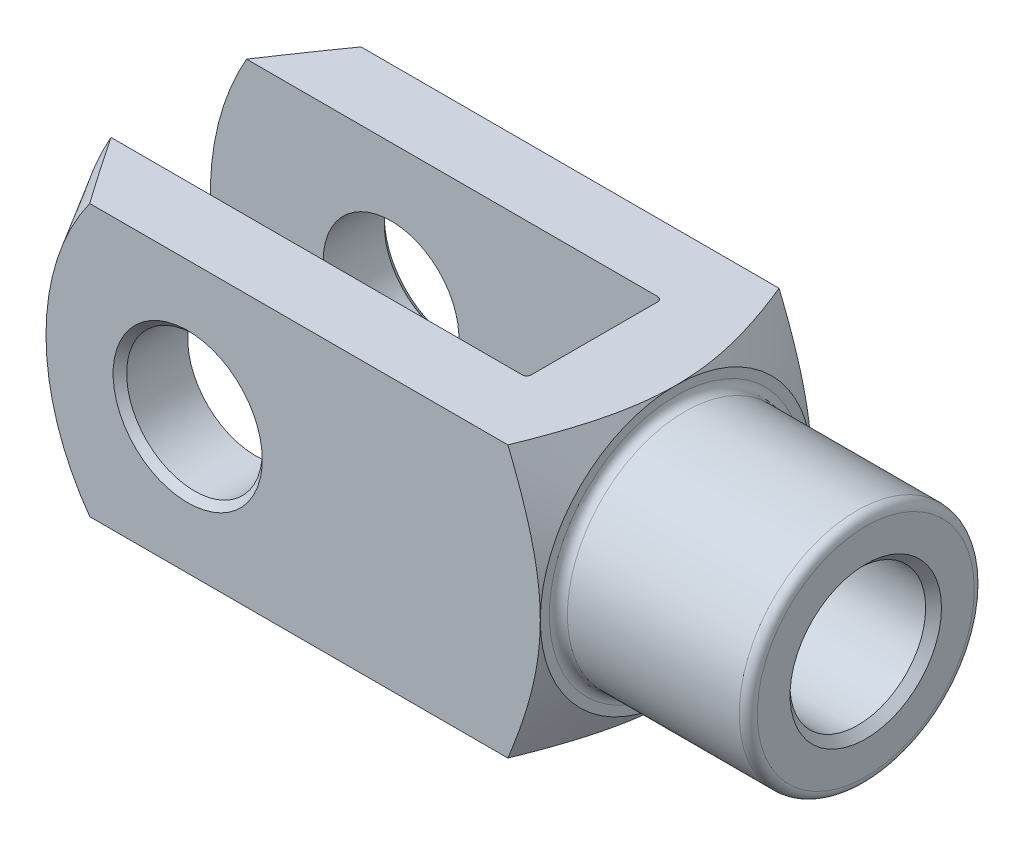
ISO-10303-21;
HEADER;
FILE_DESCRIPTION(('STEP AP214'),'2;1');
FILE_NAME('part.step','',(''),(''),'','','');
FILE_SCHEMA(('AUTOMOTIVE_DESIGN { 1 0 10303 214 1 1 1 1 }'));
ENDSEC;
DATA;
#1=APPLICATION_CONTEXT('core data for automotive mechanical design processes');
#2=APPLICATION_PROTOCOL_DEFINITION('international standard','automotive_design',2000,#1);
#3=PRODUCT_CONTEXT('',#1,'mechanical');
#4=PRODUCT('Part','Part','',(#3));
#5=PRODUCT_RELATED_PRODUCT_CATEGORY('part','',(#4));
#6=PRODUCT_DEFINITION_FORMATION('','',#4);
#7=PRODUCT_DEFINITION_CONTEXT('part definition',#1,'design');
#8=PRODUCT_DEFINITION('design','',#6,#7);
#9=PRODUCT_DEFINITION_SHAPE('','',#8);
#10=(LENGTH_UNIT() NAMED_UNIT(*) SI_UNIT(.MILLI.,.METRE.));
#11=(NAMED_UNIT(*) PLANE_ANGLE_UNIT() SI_UNIT($,.RADIAN.));
#12=(NAMED_UNIT(*) SI_UNIT($,.STERADIAN.) SOLID_ANGLE_UNIT());
#13=UNCERTAINTY_MEASURE_WITH_UNIT(LENGTH_MEASURE(1.E-05),#10,'distance_accuracy_value','');
#14=(GEOMETRIC_REPRESENTATION_CONTEXT(3) GLOBAL_UNCERTAINTY_ASSIGNED_CONTEXT((#13)) GLOBAL_UNIT_ASSIGNED_CONTEXT((#10,
#11,#12)) REPRESENTATION_CONTEXT('',''));
#15=CARTESIAN_POINT('',(0.,0.,0.));
#16=DIRECTION('',(0.,0.,1.));
#17=DIRECTION('',(1.,0.,0.));
#18=AXIS2_PLACEMENT_3D('',#15,#16,#17);
#19=CARTESIAN_POINT('',(-61.,-30.,-14.));
#20=DIRECTION('',(0.,-1.,0.));
#21=DIRECTION('',(0.,0.,-1.));
#22=AXIS2_PLACEMENT_3D('',#19,#20,#21);
#23=CYLINDRICAL_SURFACE('',#22,1.);
#24=DIRECTION('',(0.,1.,0.));
#25=VECTOR('',#24,1.);
#26=CARTESIAN_POINT('',(-60.,-30.,-14.));
#27=LINE('',#26,#25);
#28=CARTESIAN_POINT('',(-60.,-5.38516480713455,-14.));
#29=VERTEX_POINT('',#28);
#30=CARTESIAN_POINT('',(-60.,-30.,-14.));
#31=VERTEX_POINT('',#30);
#32=EDGE_CURVE('E357',#29,#31,#27,.F.);
#33=ORIENTED_EDGE('',*,*,#32,.F.);
#34=CARTESIAN_POINT('',(-60.,-5.38516480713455,-14.));
#35=CARTESIAN_POINT('',(-60.0000082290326,-5.30654221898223,-14.0302430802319));
#36=CARTESIAN_POINT('',(-60.0013709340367,-5.22767688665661,-14.05981811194));
#37=CARTESIAN_POINT('',(-60.0065144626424,-5.06954390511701,-14.1176062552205));
#38=CARTESIAN_POINT('',(-60.0102947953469,-4.99027634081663,-14.1458196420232));
#39=CARTESIAN_POINT('',(-60.0248165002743,-4.75212047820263,-14.2283365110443));
#40=CARTESIAN_POINT('',(-60.0387398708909,-4.59270703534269,-14.2805828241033));
#41=CARTESIAN_POINT('',(-60.073294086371,-4.2732438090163,-14.3794052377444));
#42=CARTESIAN_POINT('',(-60.0939112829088,-4.11319596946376,-14.4259926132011));
#43=CARTESIAN_POINT('',(-60.140562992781,-3.79233201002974,-14.5136450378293));
#44=CARTESIAN_POINT('',(-60.1665995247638,-3.63151562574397,-14.5547080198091));
#45=CARTESIAN_POINT('',(-60.2447603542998,-3.18519590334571,-14.6608478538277));
#46=CARTESIAN_POINT('',(-60.3015289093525,-2.89908660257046,-14.7200516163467));
#47=CARTESIAN_POINT('',(-60.424188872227,-2.32586428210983,-14.8214427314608));
#48=CARTESIAN_POINT('',(-60.4900830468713,-2.03875098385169,-14.8636249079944));
#49=CARTESIAN_POINT('',(-60.6962991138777,-1.17626175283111,-14.965008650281));
#50=CARTESIAN_POINT('',(-60.8451745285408,-0.599636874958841,-14.9990708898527));
#51=CARTESIAN_POINT('',(-60.9959175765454,-0.0158112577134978,-14.9999937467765));
#52=CARTESIAN_POINT('',(-60.9979588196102,-0.00790555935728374,-14.9999999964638));
#53=CARTESIAN_POINT('',(-61.,0.,-15.));
#54=B_SPLINE_CURVE_WITH_KNOTS('',3,(#34,#35,#36,#37,#38,#39,#40,#41,#42,#43,#44,#45,#46,#47,#48,
#49,#50,#51,#52,#53),.UNSPECIFIED.,.F.,.F.,(4,2,2,2,2,2,2,2,2,4),(0.,0.252681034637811,
0.50531077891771,1.01001851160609,1.51370356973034,2.01757658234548,2.9096568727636,
3.80200823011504,5.58640000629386,5.6108949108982),.UNSPECIFIED.);
#55=CARTESIAN_POINT('',(-61.,0.,-15.));
#56=VERTEX_POINT('',#55);
#57=EDGE_CURVE('E390',#29,#56,#54,.T.);
#58=ORIENTED_EDGE('',*,*,#57,.T.);
#59=DIRECTION('',(0.,1.,0.));
#60=VECTOR('',#59,1.);
#61=CARTESIAN_POINT('',(-61.,30.,-15.));
#62=LINE('',#61,#60);
#63=CARTESIAN_POINT('',(-61.,-30.,-15.));
#64=VERTEX_POINT('',#63);
#65=EDGE_CURVE('E182',#64,#56,#62,.T.);
#66=ORIENTED_EDGE('',*,*,#65,.F.);
#67=CARTESIAN_POINT('',(-61.,-30.,-14.));
#68=DIRECTION('',(0.,-1.,0.));
#69=DIRECTION('',(0.,0.,-1.));
#70=AXIS2_PLACEMENT_3D('',#67,#68,#69);
#71=CIRCLE('',#70,1.);
#72=EDGE_CURVE('E197',#31,#64,#71,.F.);
#73=ORIENTED_EDGE('',*,*,#72,.F.);
#74=EDGE_LOOP('',(#33,#58,#66,#73));
#75=FACE_BOUND('',#74,.T.);
#76=ADVANCED_FACE('F37',(#75),#23,.F.);
#77=CARTESIAN_POINT('',(-60.,-30.,-15.));
#78=DIRECTION('',(1.,0.,0.));
#79=DIRECTION('',(0.,0.,-1.));
#80=AXIS2_PLACEMENT_3D('',#77,#78,#79);
#81=PLANE('',#80);
#82=CARTESIAN_POINT('',(-60.,30.,-14.));
#83=VERTEX_POINT('',#82);
#84=CARTESIAN_POINT('',(-60.,5.38516480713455,-14.));
#85=VERTEX_POINT('',#84);
#86=EDGE_CURVE('E373',#83,#85,#27,.F.);
#87=ORIENTED_EDGE('',*,*,#86,.T.);
#88=CARTESIAN_POINT('',(-60.,0.,0.));
#89=DIRECTION('',(1.,0.,0.));
#90=DIRECTION('',(0.,0.,-1.));
#91=AXIS2_PLACEMENT_3D('',#88,#89,#90);
#92=CIRCLE('',#91,15.);
#93=CARTESIAN_POINT('',(-60.,5.38516480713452,14.));
#94=VERTEX_POINT('',#93);
#95=EDGE_CURVE('E413',#85,#94,#92,.T.);
#96=ORIENTED_EDGE('',*,*,#95,.T.);
#97=DIRECTION('',(0.,1.,0.));
#98=VECTOR('',#97,1.);
#99=CARTESIAN_POINT('',(-60.,30.,14.));
#100=LINE('',#99,#98);
#101=CARTESIAN_POINT('',(-60.,30.,14.));
#102=VERTEX_POINT('',#101);
#103=EDGE_CURVE('E160',#94,#102,#100,.T.);
#104=ORIENTED_EDGE('',*,*,#103,.T.);
#105=DIRECTION('',(0.,0.,-1.));
#106=VECTOR('',#105,1.);
#107=CARTESIAN_POINT('',(-60.,30.,-15.));
#108=LINE('',#107,#106);
#109=EDGE_CURVE('E338',#102,#83,#108,.T.);
#110=ORIENTED_EDGE('',*,*,#109,.T.);
#111=EDGE_LOOP('',(#87,#96,#104,#110));
#112=FACE_BOUND('',#111,.T.);
#113=ADVANCED_FACE('F494',(#112),#81,.F.);
#114=CARTESIAN_POINT('',(-61.,-30.,14.));
#115=DIRECTION('',(0.,-1.,0.));
#116=DIRECTION('',(0.,0.,-1.));
#117=AXIS2_PLACEMENT_3D('',#114,#115,#116);
#118=CYLINDRICAL_SURFACE('',#117,1.);
#119=ORIENTED_EDGE('',*,*,#103,.F.);
#120=CARTESIAN_POINT('',(-60.,5.38516480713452,14.));
#121=CARTESIAN_POINT('',(-60.0000082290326,5.30654221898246,14.0302430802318));
#122=CARTESIAN_POINT('',(-60.0013709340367,5.22767688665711,14.0598181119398));
#123=CARTESIAN_POINT('',(-60.0065144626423,5.06954390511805,14.1176062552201));
#124=CARTESIAN_POINT('',(-60.0102947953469,4.99027634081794,14.1458196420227));
#125=CARTESIAN_POINT('',(-60.0248165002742,4.75212047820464,14.2283365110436));
#126=CARTESIAN_POINT('',(-60.0387398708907,4.59270703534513,14.2805828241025));
#127=CARTESIAN_POINT('',(-60.0732940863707,4.27324380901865,14.3794052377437));
#128=CARTESIAN_POINT('',(-60.0939112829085,4.11319596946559,14.4259926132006));
#129=CARTESIAN_POINT('',(-60.1405629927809,3.79233201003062,14.5136450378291));
#130=CARTESIAN_POINT('',(-60.1665995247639,3.63151562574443,14.554708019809));
#131=CARTESIAN_POINT('',(-60.2447603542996,3.1851959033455,14.6608478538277));
#132=CARTESIAN_POINT('',(-60.3015289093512,2.89908660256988,14.7200516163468));
#133=CARTESIAN_POINT('',(-60.4241888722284,2.32586428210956,14.8214427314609));
#134=CARTESIAN_POINT('',(-60.4900830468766,2.03875098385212,14.8636249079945));
#135=CARTESIAN_POINT('',(-60.6962991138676,1.17626175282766,14.965008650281));
#136=CARTESIAN_POINT('',(-60.8451745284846,0.59963687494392,14.9990708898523));
#137=CARTESIAN_POINT('',(-60.9959175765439,0.015811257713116,14.9999937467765));
#138=CARTESIAN_POINT('',(-60.9979588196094,0.00790555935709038,14.9999999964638));
#139=CARTESIAN_POINT('',(-61.,0.,15.));
#140=B_SPLINE_CURVE_WITH_KNOTS('',3,(#120,#121,#122,#123,#124,#125,#126,#127,#128,#129,#130,
#131,#132,#133,#134,#135,#136,#137,#138,#139),.UNSPECIFIED.,.F.,.F.,(4,2,2,2,2,2,2,2,2,4),(0.,
0.252681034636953,0.505310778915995,1.01001851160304,1.51370356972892,2.01757658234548,
2.90965687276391,3.80200823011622,5.58640000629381,5.61089491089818),.UNSPECIFIED.);
#141=CARTESIAN_POINT('',(-61.,0.,15.));
#142=VERTEX_POINT('',#141);
#143=EDGE_CURVE('E145',#94,#142,#140,.T.);
#144=ORIENTED_EDGE('',*,*,#143,.T.);
#145=DIRECTION('',(0.,1.,0.));
#146=VECTOR('',#145,1.);
#147=CARTESIAN_POINT('',(-61.,-30.,15.));
#148=LINE('',#147,#146);
#149=CARTESIAN_POINT('',(-61.,30.,15.));
#150=VERTEX_POINT('',#149);
#151=EDGE_CURVE('E159',#150,#142,#148,.F.);
#152=ORIENTED_EDGE('',*,*,#151,.F.);
#153=CARTESIAN_POINT('',(-61.,30.,14.));
#154=DIRECTION('',(0.,1.,0.));
#155=DIRECTION('',(0.,0.,1.));
#156=AXIS2_PLACEMENT_3D('',#153,#154,#155);
#157=CIRCLE('',#156,1.);
#158=EDGE_CURVE('E189',#102,#150,#157,.F.);
#159=ORIENTED_EDGE('',*,*,#158,.F.);
#160=EDGE_LOOP('',(#119,#144,#152,#159));
#161=FACE_BOUND('',#160,.T.);
#162=ADVANCED_FACE('F156',(#161),#118,.F.);
#163=CARTESIAN_POINT('',(-160.,-30.,-15.));
#164=DIRECTION('',(0.,0.,-1.));
#165=DIRECTION('',(-1.,0.,0.));
#166=AXIS2_PLACEMENT_3D('',#163,#164,#165);
#167=PLANE('',#166);
#168=CARTESIAN_POINT('',(-120.,0.,-15.));
#169=DIRECTION('',(0.,0.,-1.));
#170=DIRECTION('',(-1.,0.,0.));
#171=AXIS2_PLACEMENT_3D('',#168,#169,#170);
#172=CIRCLE('',#171,15.);
#173=CARTESIAN_POINT('',(-135.,0.,-15.));
#174=VERTEX_POINT('',#173);
#175=EDGE_CURVE('E367',#174,#174,#172,.F.);
#176=ORIENTED_EDGE('',*,*,#175,.F.);
#177=EDGE_LOOP('',(#176));
#178=FACE_BOUND('',#177,.T.);
#179=CARTESIAN_POINT('',(-100.,0.,-15.));
#180=DIRECTION('',(0.,0.,1.));
#181=DIRECTION('',(1.,0.,0.));
#182=AXIS2_PLACEMENT_3D('',#179,#180,#181);
#183=CIRCLE('',#182,60.);
#184=CARTESIAN_POINT('',(-151.961524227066,30.,-15.));
#185=VERTEX_POINT('',#184);
#186=CARTESIAN_POINT('',(-151.961524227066,-30.,-15.));
#187=VERTEX_POINT('',#186);
#188=EDGE_CURVE('E276',#185,#187,#183,.T.);
#189=ORIENTED_EDGE('',*,*,#188,.T.);
#190=DIRECTION('',(-1.,0.,0.));
#191=VECTOR('',#190,1.);
#192=CARTESIAN_POINT('',(-160.,-30.,-15.));
#193=LINE('',#192,#191);
#194=EDGE_CURVE('E333',#64,#187,#193,.T.);
#195=ORIENTED_EDGE('',*,*,#194,.F.);
#196=ORIENTED_EDGE('',*,*,#65,.T.);
#197=CARTESIAN_POINT('',(-61.,30.,-15.));
#198=VERTEX_POINT('',#197);
#199=EDGE_CURVE('E179',#56,#198,#62,.T.);
#200=ORIENTED_EDGE('',*,*,#199,.T.);
#201=DIRECTION('',(-1.,0.,0.));
#202=VECTOR('',#201,1.);
#203=CARTESIAN_POINT('',(-160.,30.,-15.));
#204=LINE('',#203,#202);
#205=EDGE_CURVE('E346',#198,#185,#204,.T.);
#206=ORIENTED_EDGE('',*,*,#205,.T.);
#207=EDGE_LOOP('',(#189,#195,#196,#200,#206));
#208=FACE_BOUND('',#207,.T.);
#209=ADVANCED_FACE('F393',(#178,#208),#167,.F.);
#210=CARTESIAN_POINT('',(-160.,-30.,15.));
#211=DIRECTION('',(0.,0.,1.));
#212=DIRECTION('',(1.,0.,0.));
#213=AXIS2_PLACEMENT_3D('',#210,#211,#212);
#214=PLANE('',#213);
#215=CARTESIAN_POINT('',(-120.,0.,15.));
#216=DIRECTION('',(0.,0.,1.));
#217=DIRECTION('',(1.,0.,0.));
#218=AXIS2_PLACEMENT_3D('',#215,#216,#217);
#219=CIRCLE('',#218,15.);
#220=CARTESIAN_POINT('',(-105.,0.,15.));
#221=VERTEX_POINT('',#220);
#222=EDGE_CURVE('E345',#221,#221,#219,.F.);
#223=ORIENTED_EDGE('',*,*,#222,.F.);
#224=EDGE_LOOP('',(#223));
#225=FACE_BOUND('',#224,.T.);
#226=DIRECTION('',(1.,0.,0.));
#227=VECTOR('',#226,1.);
#228=CARTESIAN_POINT('',(-160.,-30.,15.));
#229=LINE('',#228,#227);
#230=CARTESIAN_POINT('',(-151.961524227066,-30.,15.));
#231=VERTEX_POINT('',#230);
#232=CARTESIAN_POINT('',(-61.,-30.,15.));
#233=VERTEX_POINT('',#232);
#234=EDGE_CURVE('E337',#231,#233,#229,.T.);
#235=ORIENTED_EDGE('',*,*,#234,.F.);
#236=CARTESIAN_POINT('',(-100.,0.,15.));
#237=DIRECTION('',(0.,0.,1.));
#238=DIRECTION('',(1.,0.,0.));
#239=AXIS2_PLACEMENT_3D('',#236,#237,#238);
#240=CIRCLE('',#239,60.);
#241=CARTESIAN_POINT('',(-151.961524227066,30.,15.));
#242=VERTEX_POINT('',#241);
#243=EDGE_CURVE('E416',#242,#231,#240,.T.);
#244=ORIENTED_EDGE('',*,*,#243,.F.);
#245=DIRECTION('',(1.,0.,0.));
#246=VECTOR('',#245,1.);
#247=CARTESIAN_POINT('',(-160.,30.,15.));
#248=LINE('',#247,#246);
#249=EDGE_CURVE('E176',#242,#150,#248,.T.);
#250=ORIENTED_EDGE('',*,*,#249,.T.);
#251=ORIENTED_EDGE('',*,*,#151,.T.);
#252=EDGE_CURVE('E164',#142,#233,#148,.F.);
#253=ORIENTED_EDGE('',*,*,#252,.T.);
#254=EDGE_LOOP('',(#235,#244,#250,#251,#253));
#255=FACE_BOUND('',#254,.T.);
#256=ADVANCED_FACE('F173',(#225,#255),#214,.F.);
#257=CARTESIAN_POINT('',(-160.,-30.,30.));
#258=DIRECTION('',(0.,0.,1.));
#259=DIRECTION('',(1.,0.,0.));
#260=AXIS2_PLACEMENT_3D('',#257,#258,#259);
#261=PLANE('',#260);
#262=CARTESIAN_POINT('',(-120.,0.,30.));
#263=DIRECTION('',(0.,0.,1.));
#264=DIRECTION('',(1.,0.,0.));
#265=AXIS2_PLACEMENT_3D('',#262,#263,#264);
#266=CIRCLE('',#265,16.5);
#267=CARTESIAN_POINT('',(-103.5,0.,30.));
#268=VERTEX_POINT('',#267);
#269=EDGE_CURVE('E228',#268,#268,#266,.F.);
#270=ORIENTED_EDGE('',*,*,#269,.T.);
#271=EDGE_LOOP('',(#270));
#272=FACE_BOUND('',#271,.T.);
#273=DIRECTION('',(1.,0.,0.));
#274=VECTOR('',#273,1.);
#275=CARTESIAN_POINT('',(-160.,30.,30.));
#276=LINE('',#275,#274);
#277=CARTESIAN_POINT('',(-141.662567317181,30.,30.));
#278=VERTEX_POINT('',#277);
#279=CARTESIAN_POINT('',(-49.1743893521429,30.,30.));
#280=VERTEX_POINT('',#279);
#281=EDGE_CURVE('E364',#278,#280,#276,.T.);
#282=ORIENTED_EDGE('',*,*,#281,.F.);
#283=CARTESIAN_POINT('',(-100.,0.,30.));
#284=DIRECTION('',(0.,0.,1.));
#285=DIRECTION('',(1.,0.,0.));
#286=AXIS2_PLACEMENT_3D('',#283,#284,#285);
#287=CIRCLE('',#286,51.3397459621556);
#288=CARTESIAN_POINT('',(-141.662567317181,-30.,30.));
#289=VERTEX_POINT('',#288);
#290=EDGE_CURVE('E61',#278,#289,#287,.T.);
#291=ORIENTED_EDGE('',*,*,#290,.T.);
#292=DIRECTION('',(1.,0.,0.));
#293=VECTOR('',#292,1.);
#294=CARTESIAN_POINT('',(-160.,-30.,30.));
#295=LINE('',#294,#293);
#296=CARTESIAN_POINT('',(-49.1743893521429,-30.,30.));
#297=VERTEX_POINT('',#296);
#298=EDGE_CURVE('E361',#289,#297,#295,.T.);
#299=ORIENTED_EDGE('',*,*,#298,.T.);
#300=CARTESIAN_POINT('',(-64.0676203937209,-61.2721306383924,30.));
#301=CARTESIAN_POINT('',(-63.6842875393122,-60.532858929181,30.));
#302=CARTESIAN_POINT('',(-63.3020053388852,-59.7930426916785,30.));
#303=CARTESIAN_POINT('',(-62.5397668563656,-58.3122101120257,30.));
#304=CARTESIAN_POINT('',(-62.1598105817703,-57.5711937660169,30.));
#305=CARTESIAN_POINT('',(-61.0237330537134,-55.3461103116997,30.));
#306=CARTESIAN_POINT('',(-60.271441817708,-53.8600833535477,30.));
#307=CARTESIAN_POINT('',(-58.778071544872,-50.8791629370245,30.));
#308=CARTESIAN_POINT('',(-58.0370143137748,-49.3842585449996,30.));
#309=CARTESIAN_POINT('',(-56.5704770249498,-46.3868393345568,30.));
#310=CARTESIAN_POINT('',(-55.8449966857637,-44.8843246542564,30.));
#311=CARTESIAN_POINT('',(-54.7494739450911,-42.5771971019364,30.));
#312=CARTESIAN_POINT('',(-54.3723843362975,-41.775928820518,30.));
#313=CARTESIAN_POINT('',(-53.6245018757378,-40.1704608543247,30.));
#314=CARTESIAN_POINT('',(-53.2537089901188,-39.366261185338,30.));
#315=CARTESIAN_POINT('',(-52.5192756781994,-37.7545431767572,30.));
#316=CARTESIAN_POINT('',(-52.1556356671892,-36.9470246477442,30.));
#317=CARTESIAN_POINT('',(-51.4365698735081,-35.3283308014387,30.));
#318=CARTESIAN_POINT('',(-51.0811441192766,-34.5171554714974,30.));
#319=CARTESIAN_POINT('',(-50.3798881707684,-32.8910810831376,30.));
#320=CARTESIAN_POINT('',(-50.034053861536,-32.0761838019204,30.));
#321=CARTESIAN_POINT('',(-49.3532732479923,-30.441856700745,30.));
#322=CARTESIAN_POINT('',(-49.0183268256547,-29.6224269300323,30.));
#323=CARTESIAN_POINT('',(-48.3610698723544,-27.9786160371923,30.));
#324=CARTESIAN_POINT('',(-48.0387578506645,-27.154235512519,30.));
#325=CARTESIAN_POINT('',(-47.4087417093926,-25.4998606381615,30.));
#326=CARTESIAN_POINT('',(-47.1010382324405,-24.669866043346,30.));
#327=CARTESIAN_POINT('',(-46.4377423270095,-22.8231172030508,30.));
#328=CARTESIAN_POINT('',(-46.0862317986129,-21.8048880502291,30.));
#329=CARTESIAN_POINT('',(-45.4134595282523,-19.7585295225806,30.));
#330=CARTESIAN_POINT('',(-45.0921951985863,-18.7304010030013,30.));
#331=CARTESIAN_POINT('',(-44.4858787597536,-16.6634632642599,30.));
#332=CARTESIAN_POINT('',(-44.2008258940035,-15.6246542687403,30.));
#333=CARTESIAN_POINT('',(-43.6737396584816,-13.5361087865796,30.));
#334=CARTESIAN_POINT('',(-43.4317058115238,-12.4863724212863,30.));
#335=CARTESIAN_POINT('',(-43.0030483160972,-10.4011527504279,30.));
#336=CARTESIAN_POINT('',(-42.815257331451,-9.36591330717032,30.));
#337=CARTESIAN_POINT('',(-42.5745074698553,-7.80678497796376,30.));
#338=CARTESIAN_POINT('',(-42.501078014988,-7.28600821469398,30.));
#339=CARTESIAN_POINT('',(-42.3685816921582,-6.24263916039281,30.));
#340=CARTESIAN_POINT('',(-42.30951415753,-5.72004695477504,30.));
#341=CARTESIAN_POINT('',(-42.2064028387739,-4.67369371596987,30.));
#342=CARTESIAN_POINT('',(-42.1623501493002,-4.14993356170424,30.));
#343=CARTESIAN_POINT('',(-42.0897145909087,-3.10136165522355,30.));
#344=CARTESIAN_POINT('',(-42.0611310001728,-2.57654995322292,30.));
#345=CARTESIAN_POINT('',(-42.0197643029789,-1.52630334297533,30.));
#346=CARTESIAN_POINT('',(-42.0069811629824,-1.00086843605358,30.));
#347=CARTESIAN_POINT('',(-41.9973673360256,0.0501448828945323,30.));
#348=CARTESIAN_POINT('',(-42.000536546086,0.575723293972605,30.));
#349=CARTESIAN_POINT('',(-42.0219788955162,1.58823940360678,30.));
#350=CARTESIAN_POINT('',(-42.0391341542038,2.07520096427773,30.));
#351=CARTESIAN_POINT('',(-42.0869412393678,3.04846603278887,30.));
#352=CARTESIAN_POINT('',(-42.1175935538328,3.53476951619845,30.));
#353=CARTESIAN_POINT('',(-42.22937419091,4.99210807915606,30.));
#354=CARTESIAN_POINT('',(-42.3303287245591,5.96168473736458,30.));
#355=CARTESIAN_POINT('',(-42.5814462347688,7.8948252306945,30.));
#356=CARTESIAN_POINT('',(-42.7316346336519,8.85838569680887,30.));
#357=CARTESIAN_POINT('',(-43.0762587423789,10.7775257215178,30.));
#358=CARTESIAN_POINT('',(-43.2706956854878,11.7331050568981,30.));
#359=CARTESIAN_POINT('',(-43.7046000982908,13.6629858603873,30.));
#360=CARTESIAN_POINT('',(-43.9452080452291,14.6370286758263,30.));
#361=CARTESIAN_POINT('',(-44.4617458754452,16.575659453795,30.));
#362=CARTESIAN_POINT('',(-44.7376760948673,17.5402473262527,30.));
#363=CARTESIAN_POINT('',(-45.1740597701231,18.9802177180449,30.));
#364=CARTESIAN_POINT('',(-45.3232675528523,19.4590515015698,30.));
#365=CARTESIAN_POINT('',(-45.6285897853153,20.4145158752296,30.));
#366=CARTESIAN_POINT('',(-45.7847042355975,20.8911464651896,30.));
#367=CARTESIAN_POINT('',(-46.1032635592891,21.842252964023,30.));
#368=CARTESIAN_POINT('',(-46.2657080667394,22.3167289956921,30.));
#369=CARTESIAN_POINT('',(-46.5964184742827,23.2636425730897,30.));
#370=CARTESIAN_POINT('',(-46.7646843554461,23.736080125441,30.));
#371=CARTESIAN_POINT('',(-47.3053438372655,25.2273271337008,30.));
#372=CARTESIAN_POINT('',(-47.6875549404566,26.2425868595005,30.));
#373=CARTESIAN_POINT('',(-48.4727290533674,28.2650739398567,30.));
#374=CARTESIAN_POINT('',(-48.8756933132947,29.2723008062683,30.));
#375=CARTESIAN_POINT('',(-49.6990231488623,31.2798668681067,30.));
#376=CARTESIAN_POINT('',(-50.1193926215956,32.2802044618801,30.));
#377=CARTESIAN_POINT('',(-50.9746371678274,34.27462207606,30.));
#378=CARTESIAN_POINT('',(-51.4095119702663,35.2687022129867,30.));
#379=CARTESIAN_POINT('',(-52.2918767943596,37.2522665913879,30.));
#380=CARTESIAN_POINT('',(-52.7393773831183,38.2417461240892,30.));
#381=CARTESIAN_POINT('',(-53.6447705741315,40.2159368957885,30.));
#382=CARTESIAN_POINT('',(-54.1026632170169,41.2006481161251,30.));
#383=CARTESIAN_POINT('',(-55.0272585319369,43.165785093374,30.));
#384=CARTESIAN_POINT('',(-55.4939602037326,44.1462113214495,30.));
#385=CARTESIAN_POINT('',(-56.4349656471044,46.1034032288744,30.));
#386=CARTESIAN_POINT('',(-56.9092694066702,47.080168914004,30.));
#387=CARTESIAN_POINT('',(-57.8658912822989,49.0334543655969,30.));
#388=CARTESIAN_POINT('',(-58.348229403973,50.0099643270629,30.));
#389=CARTESIAN_POINT('',(-59.3186378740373,51.960133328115,30.));
#390=CARTESIAN_POINT('',(-59.8067082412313,52.9337923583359,30.));
#391=CARTESIAN_POINT('',(-61.2784040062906,55.8510345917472,30.));
#392=CARTESIAN_POINT('',(-62.269498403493,57.7908510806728,30.));
#393=CARTESIAN_POINT('',(-64.2665281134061,61.6615986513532,30.));
#394=CARTESIAN_POINT('',(-65.2724558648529,63.5925336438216,30.));
#395=CARTESIAN_POINT('',(-67.2963715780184,67.4480486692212,30.));
#396=CARTESIAN_POINT('',(-68.3143594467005,69.3726287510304,30.));
#397=CARTESIAN_POINT('',(-70.2080902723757,72.9312133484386,30.));
#398=CARTESIAN_POINT('',(-71.082506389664,74.5659247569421,30.));
#399=CARTESIAN_POINT('',(-72.8371969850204,77.8322019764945,30.));
#400=CARTESIAN_POINT('',(-73.7174714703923,79.4637677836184,30.));
#401=CARTESIAN_POINT('',(-75.4830843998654,82.7244516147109,30.));
#402=CARTESIAN_POINT('',(-76.3684235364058,84.353569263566,30.));
#403=CARTESIAN_POINT('',(-78.1433082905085,87.6095117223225,30.));
#404=CARTESIAN_POINT('',(-79.0328539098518,89.2363365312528,30.));
#405=CARTESIAN_POINT('',(-80.8104465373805,92.4786949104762,30.));
#406=CARTESIAN_POINT('',(-81.6984729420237,94.0942397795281,30.));
#407=CARTESIAN_POINT('',(-83.47760977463,97.3236307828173,30.));
#408=CARTESIAN_POINT('',(-84.3687202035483,98.9374769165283,30.));
#409=CARTESIAN_POINT('',(-86.1534802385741,102.163431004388,30.));
#410=CARTESIAN_POINT('',(-87.0471294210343,103.775539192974,30.));
#411=CARTESIAN_POINT('',(-88.8367829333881,106.998445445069,30.));
#412=CARTESIAN_POINT('',(-89.7327872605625,108.609243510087,30.));
#413=CARTESIAN_POINT('',(-90.6298080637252,110.219474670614,30.));
#414=B_SPLINE_CURVE_WITH_KNOTS('',3,(#300,#301,#302,#303,#304,#305,#306,#307,#308,#309,#310,
#311,#312,#313,#314,#315,#316,#317,#318,#319,#320,#321,#322,#323,#324,#325,#326,#327,#328,#329,
#330,#331,#332,#333,#334,#335,#336,#337,#338,#339,#340,#341,#342,#343,#344,#345,#346,#347,#348,
#349,#350,#351,#352,#353,#354,#355,#356,#357,#358,#359,#360,#361,#362,#363,#364,#365,#366,#367,
#368,#369,#370,#371,#372,#373,#374,#375,#376,#377,#378,#379,#380,#381,#382,#383,#384,#385,#386,
#387,#388,#389,#390,#391,#392,#393,#394,#395,#396,#397,#398,#399,#400,#401,#402,#403,#404,#405,
#406,#407,#408,#409,#410,#411,#412,#413),.UNSPECIFIED.,.F.,.F.,(4,2,2,2,2,2,2,2,2,2,2,2,2,2,2,2,
2,2,2,2,2,2,2,2,2,2,2,2,2,2,2,2,2,2,2,2,2,2,2,2,2,2,2,2,2,2,2,2,2,2,2,2,2,2,2,2,4),(0.,
2.49823775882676,4.9964835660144,9.9932272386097,14.9986720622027,20.0040263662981,
22.6607028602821,25.3173650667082,27.974181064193,30.6310062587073,33.2866734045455,
35.942311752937,38.5976358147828,41.2530765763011,44.4842625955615,47.715171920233,
50.9460137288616,54.1768196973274,57.3317853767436,58.9094034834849,60.486948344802,
62.0635559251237,63.6400899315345,65.2166205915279,66.7931410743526,68.2547370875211,
69.7163859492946,72.6393436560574,75.5638130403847,78.4883639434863,81.4975634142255,
84.5067915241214,86.0113774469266,87.5159634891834,89.0204626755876,90.5249569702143,
93.7791124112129,97.033464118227,100.28854846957,103.543572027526,106.801405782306,
110.059252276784,113.316731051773,116.574204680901,119.841597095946,123.109000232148,
129.643912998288,136.175602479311,142.707241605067,148.268879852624,153.830525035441,
159.392949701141,164.955376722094,170.485941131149,176.016507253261,181.54619913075,
187.075884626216),.UNSPECIFIED.);
#415=CARTESIAN_POINT('',(-42.,0.,30.));
#416=VERTEX_POINT('',#415);
#417=EDGE_CURVE('E305',#416,#297,#414,.F.);
#418=ORIENTED_EDGE('',*,*,#417,.F.);
#419=EDGE_CURVE('E303',#280,#416,#414,.F.);
#420=ORIENTED_EDGE('',*,*,#419,.F.);
#421=EDGE_LOOP('',(#282,#291,#299,#418,#420));
#422=FACE_BOUND('',#421,.T.);
#423=ADVANCED_FACE('F287',(#272,#422),#261,.T.);
#424=CARTESIAN_POINT('',(-160.,-30.,30.));
#425=DIRECTION('',(0.,-1.,0.));
#426=DIRECTION('',(0.,0.,-1.));
#427=AXIS2_PLACEMENT_3D('',#424,#425,#426);
#428=PLANE('',#427);
#429=ORIENTED_EDGE('',*,*,#194,.T.);
#430=CARTESIAN_POINT('',(-175.69632116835,-30.,22.1081506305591));
#431=CARTESIAN_POINT('',(-174.966529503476,-30.,20.933043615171));
#432=CARTESIAN_POINT('',(-174.235709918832,-30.,19.7585749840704));
#433=CARTESIAN_POINT('',(-172.77182047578,-30.,17.411040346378));
#434=CARTESIAN_POINT('',(-172.038750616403,-30.,16.2379743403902));
#435=CARTESIAN_POINT('',(-169.835846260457,-30.,12.7210248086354));
#436=CARTESIAN_POINT('',(-168.362345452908,-30.,10.3794356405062));
#437=CARTESIAN_POINT('',(-165.401888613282,-30.,5.70085627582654));
#438=CARTESIAN_POINT('',(-163.914918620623,-30.,3.36387490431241));
#439=CARTESIAN_POINT('',(-161.67380163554,-30.,-0.134747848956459));
#440=CARTESIAN_POINT('',(-160.924989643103,-30.,-1.29980771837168));
#441=CARTESIAN_POINT('',(-159.423412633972,-30.,-3.6273895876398));
#442=CARTESIAN_POINT('',(-158.670647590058,-30.,-4.78991156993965));
#443=CARTESIAN_POINT('',(-157.129308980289,-30.,-7.16043682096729));
#444=CARTESIAN_POINT('',(-156.340549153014,-30.,-8.3683190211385));
#445=CARTESIAN_POINT('',(-154.757698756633,-30.,-10.7805852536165));
#446=CARTESIAN_POINT('',(-153.963608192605,-30.,-11.9849692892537));
#447=CARTESIAN_POINT('',(-152.369428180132,-30.,-14.3897492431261));
#448=CARTESIAN_POINT('',(-151.569338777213,-30.,-15.5901451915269));
#449=CARTESIAN_POINT('',(-149.962363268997,-30.,-17.9863760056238));
#450=CARTESIAN_POINT('',(-149.155477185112,-30.,-19.1822108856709));
#451=CARTESIAN_POINT('',(-147.53455926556,-30.,-21.5677433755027));
#452=CARTESIAN_POINT('',(-146.720533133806,-30.,-22.7574448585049));
#453=CARTESIAN_POINT('',(-145.083618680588,-30.,-25.1307438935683));
#454=CARTESIAN_POINT('',(-144.260730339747,-30.,-26.3143414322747));
#455=CARTESIAN_POINT('',(-142.604766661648,-30.,-28.6743145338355));
#456=CARTESIAN_POINT('',(-141.771691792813,-30.,-29.8506904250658));
#457=CARTESIAN_POINT('',(-140.093661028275,-30.,-32.1949287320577));
#458=CARTESIAN_POINT('',(-139.24870525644,-30.,-33.3627912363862));
#459=CARTESIAN_POINT('',(-137.552785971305,-30.,-35.6774790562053));
#460=CARTESIAN_POINT('',(-136.701951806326,-30.,-36.8243989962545));
#461=CARTESIAN_POINT('',(-134.984083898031,-30.,-39.1060929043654));
#462=CARTESIAN_POINT('',(-134.117049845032,-30.,-40.2408666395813));
#463=CARTESIAN_POINT('',(-132.362443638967,-30.,-42.4969804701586));
#464=CARTESIAN_POINT('',(-131.474844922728,-30.,-43.618299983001));
#465=CARTESIAN_POINT('',(-130.125884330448,-30.,-45.2860308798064));
#466=CARTESIAN_POINT('',(-129.673310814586,-30.,-45.8395580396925));
#467=CARTESIAN_POINT('',(-128.761672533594,-30.,-46.941236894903));
#468=CARTESIAN_POINT('',(-128.302607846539,-30.,-47.489388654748));
#469=CARTESIAN_POINT('',(-127.382070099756,-30.,-48.5739517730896));
#470=CARTESIAN_POINT('',(-126.920671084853,-30.,-49.1104259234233));
#471=CARTESIAN_POINT('',(-125.990051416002,-30.,-50.176536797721));
#472=CARTESIAN_POINT('',(-125.520830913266,-30.,-50.7061736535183));
#473=CARTESIAN_POINT('',(-124.573526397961,-30.,-51.7577460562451));
#474=CARTESIAN_POINT('',(-124.095439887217,-30.,-52.2796793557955));
#475=CARTESIAN_POINT('',(-123.129504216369,-30.,-53.3144382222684));
#476=CARTESIAN_POINT('',(-122.641655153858,-30.,-53.8272638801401));
#477=CARTESIAN_POINT('',(-121.656102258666,-30.,-54.8411494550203));
#478=CARTESIAN_POINT('',(-121.158422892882,-30.,-55.342233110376));
#479=CARTESIAN_POINT('',(-120.150771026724,-30.,-56.3319631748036));
#480=CARTESIAN_POINT('',(-119.640797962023,-30.,-56.8206090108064));
#481=CARTESIAN_POINT('',(-118.607319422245,-30.,-57.7828189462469));
#482=CARTESIAN_POINT('',(-118.0838216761,-30.,-58.2563913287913));
#483=CARTESIAN_POINT('',(-117.021319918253,-30.,-59.1857484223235));
#484=CARTESIAN_POINT('',(-116.482318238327,-30.,-59.6415357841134));
#485=CARTESIAN_POINT('',(-115.650944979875,-30.,-60.3170047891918));
#486=CARTESIAN_POINT('',(-115.364961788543,-30.,-60.5445684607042));
#487=CARTESIAN_POINT('',(-114.788008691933,-30.,-60.993296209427));
#488=CARTESIAN_POINT('',(-114.497038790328,-30.,-61.2144602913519));
#489=CARTESIAN_POINT('',(-113.9097565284,-30.,-61.6497334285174));
#490=CARTESIAN_POINT('',(-113.613442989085,-30.,-61.8638408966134));
#491=CARTESIAN_POINT('',(-113.015258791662,-30.,-62.2841325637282));
#492=CARTESIAN_POINT('',(-112.713388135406,-30.,-62.4903167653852));
#493=CARTESIAN_POINT('',(-111.799476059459,-30.,-63.0953537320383));
#494=CARTESIAN_POINT('',(-111.178620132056,-30.,-63.4810758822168));
#495=CARTESIAN_POINT('',(-109.911717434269,-30.,-64.2087365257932));
#496=CARTESIAN_POINT('',(-109.265677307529,-30.,-64.5506864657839));
#497=CARTESIAN_POINT('',(-108.097990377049,-30.,-65.1084062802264));
#498=CARTESIAN_POINT('',(-107.581607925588,-30.,-65.335161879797));
#499=CARTESIAN_POINT('',(-106.533725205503,-30.,-65.7507931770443));
#500=CARTESIAN_POINT('',(-106.002226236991,-30.,-65.9396721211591));
#501=CARTESIAN_POINT('',(-104.926311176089,-30.,-66.2735757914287));
#502=CARTESIAN_POINT('',(-104.381914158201,-30.,-66.4186613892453));
#503=CARTESIAN_POINT('',(-103.282303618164,-30.,-66.6599753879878));
#504=CARTESIAN_POINT('',(-102.72709059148,-30.,-66.7562060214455));
#505=CARTESIAN_POINT('',(-101.604376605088,-30.,-66.8963942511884));
#506=CARTESIAN_POINT('',(-101.036808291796,-30.,-66.939819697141));
#507=CARTESIAN_POINT('',(-99.9001598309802,-30.,-66.9705580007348));
#508=CARTESIAN_POINT('',(-99.3310797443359,-30.,-66.9578730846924));
#509=CARTESIAN_POINT('',(-98.1968075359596,-30.,-66.877003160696));
#510=CARTESIAN_POINT('',(-97.6316162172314,-30.,-66.8088070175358));
#511=CARTESIAN_POINT('',(-96.5100862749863,-30.,-66.620054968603));
#512=CARTESIAN_POINT('',(-95.9537490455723,-30.,-66.4994909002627));
#513=CARTESIAN_POINT('',(-94.7516549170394,-30.,-66.1841691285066));
#514=CARTESIAN_POINT('',(-94.1084281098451,-30.,-65.9798037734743));
#515=CARTESIAN_POINT('',(-92.8430678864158,-30.,-65.5140934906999));
#516=CARTESIAN_POINT('',(-92.2209409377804,-30.,-65.2527312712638));
#517=CARTESIAN_POINT('',(-90.9970720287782,-30.,-64.6818034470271));
#518=CARTESIAN_POINT('',(-90.3953980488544,-30.,-64.3720932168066));
#519=CARTESIAN_POINT('',(-89.5094521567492,-30.,-63.8783361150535));
#520=CARTESIAN_POINT('',(-89.2168991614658,-30.,-63.7088860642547));
#521=CARTESIAN_POINT('',(-88.6370852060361,-30.,-63.361139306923));
#522=CARTESIAN_POINT('',(-88.3498243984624,-30.,-63.182842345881));
#523=CARTESIAN_POINT('',(-87.3090487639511,-30.,-62.5165051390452));
#524=CARTESIAN_POINT('',(-86.570906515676,-30.,-62.0043202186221));
#525=CARTESIAN_POINT('',(-85.1263383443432,-30.,-60.9368688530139));
#526=CARTESIAN_POINT('',(-84.4199291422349,-30.,-60.3815801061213));
#527=CARTESIAN_POINT('',(-83.0334534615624,-30.,-59.2365720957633));
#528=CARTESIAN_POINT('',(-82.3534399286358,-30.,-58.6467890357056));
#529=CARTESIAN_POINT('',(-81.0174173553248,-30.,-57.4410133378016));
#530=CARTESIAN_POINT('',(-80.3614041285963,-30.,-56.8250253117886));
#531=CARTESIAN_POINT('',(-79.065538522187,-30.,-55.5678176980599));
#532=CARTESIAN_POINT('',(-78.4258237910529,-30.,-54.9264567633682));
#533=CARTESIAN_POINT('',(-77.1642253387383,-30.,-53.6264415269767));
#534=CARTESIAN_POINT('',(-76.5423422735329,-30.,-52.9677865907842));
#535=CARTESIAN_POINT('',(-75.3146330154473,-30.,-51.6369785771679));
#536=CARTESIAN_POINT('',(-74.708790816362,-30.,-50.964840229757));
#537=CARTESIAN_POINT('',(-73.510486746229,-30.,-49.608791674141));
#538=CARTESIAN_POINT('',(-72.9180246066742,-30.,-48.9248817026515));
#539=CARTESIAN_POINT('',(-71.501588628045,-30.,-47.2616181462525));
#540=CARTESIAN_POINT('',(-70.6834424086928,-30.,-46.2773039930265));
#541=CARTESIAN_POINT('',(-69.0664056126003,-30.,-44.2927173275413));
#542=CARTESIAN_POINT('',(-68.26751886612,-30.,-43.2924417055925));
#543=CARTESIAN_POINT('',(-66.6982059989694,-30.,-41.2944935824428));
#544=CARTESIAN_POINT('',(-65.9275313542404,-30.,-40.2970160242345));
#545=CARTESIAN_POINT('',(-64.7817713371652,-30.,-38.7932469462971));
#546=CARTESIAN_POINT('',(-64.4016152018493,-30.,-38.2908063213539));
#547=CARTESIAN_POINT('',(-63.6444407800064,-30.,-37.2835734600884));
#548=CARTESIAN_POINT('',(-63.2674224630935,-30.,-36.7787812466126));
#549=CARTESIAN_POINT('',(-62.8918493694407,-30.,-36.2729151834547));
#550=B_SPLINE_CURVE_WITH_KNOTS('',3,(#430,#431,#432,#433,#434,#435,#436,#437,#438,#439,#440,
#441,#442,#443,#444,#445,#446,#447,#448,#449,#450,#451,#452,#453,#454,#455,#456,#457,#458,#459,
#460,#461,#462,#463,#464,#465,#466,#467,#468,#469,#470,#471,#472,#473,#474,#475,#476,#477,#478,
#479,#480,#481,#482,#483,#484,#485,#486,#487,#488,#489,#490,#491,#492,#493,#494,#495,#496,#497,
#498,#499,#500,#501,#502,#503,#504,#505,#506,#507,#508,#509,#510,#511,#512,#513,#514,#515,#516,
#517,#518,#519,#520,#521,#522,#523,#524,#525,#526,#527,#528,#529,#530,#531,#532,#533,#534,#535,
#536,#537,#538,#539,#540,#541,#542,#543,#544,#545,#546,#547,#548,#549),.UNSPECIFIED.,.F.,.F.,(4,
2,2,2,2,2,2,2,2,2,2,2,2,2,2,2,2,2,2,2,2,2,2,2,2,2,2,2,2,2,2,2,2,2,2,2,2,2,2,2,2,2,2,2,2,2,2,2,2,
2,2,2,2,2,2,2,2,2,2,4),(0.,4.14984877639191,8.29969933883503,16.5995624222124,24.9093319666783,
29.0641726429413,33.2190419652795,37.5468572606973,41.8746684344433,46.2024467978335,
50.5302115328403,54.8547871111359,59.1793721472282,63.5037590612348,67.8281009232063,
72.1121476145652,76.3962762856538,80.6862867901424,82.8312260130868,84.976139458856,
87.0988634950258,89.2215465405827,91.344837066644,93.4681063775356,95.586629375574,
97.7052498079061,99.8226851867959,101.939803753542,103.036152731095,104.13250090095,
105.229093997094,106.325686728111,108.516947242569,110.707633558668,112.398299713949,
114.088820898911,115.776981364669,117.465064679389,119.17002250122,120.874912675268,
122.580144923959,124.285643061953,126.307127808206,128.329226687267,130.357494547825,
131.371618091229,132.385770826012,135.078782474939,137.773196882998,140.472762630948,
143.171855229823,145.889023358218,148.606291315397,151.320737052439,154.035128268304,
157.874615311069,161.71485974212,165.496264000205,167.386409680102,169.276537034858),.UNSPECIFIED.);
#551=CARTESIAN_POINT('',(-141.662567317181,-30.,-30.));
#552=VERTEX_POINT('',#551);
#553=EDGE_CURVE('E275',#187,#552,#550,.T.);
#554=ORIENTED_EDGE('',*,*,#553,.T.);
#555=DIRECTION('',(1.,0.,0.));
#556=VECTOR('',#555,1.);
#557=CARTESIAN_POINT('',(-160.,-30.,-30.));
#558=LINE('',#557,#556);
#559=CARTESIAN_POINT('',(-49.1743893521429,-30.,-30.));
#560=VERTEX_POINT('',#559);
#561=EDGE_CURVE('E358',#552,#560,#558,.T.);
#562=ORIENTED_EDGE('',*,*,#561,.T.);
#563=CARTESIAN_POINT('',(-64.0676203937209,-30.,-61.2721306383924));
#564=CARTESIAN_POINT('',(-63.6842875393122,-30.,-60.532858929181));
#565=CARTESIAN_POINT('',(-63.3020053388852,-30.,-59.7930426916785));
#566=CARTESIAN_POINT('',(-62.5397668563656,-30.,-58.3122101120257));
#567=CARTESIAN_POINT('',(-62.1598105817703,-30.,-57.5711937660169));
#568=CARTESIAN_POINT('',(-61.0237330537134,-30.,-55.3461103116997));
#569=CARTESIAN_POINT('',(-60.271441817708,-30.,-53.8600833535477));
#570=CARTESIAN_POINT('',(-58.778071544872,-30.,-50.8791629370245));
#571=CARTESIAN_POINT('',(-58.0370143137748,-30.,-49.3842585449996));
#572=CARTESIAN_POINT('',(-56.5704770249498,-30.,-46.3868393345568));
#573=CARTESIAN_POINT('',(-55.8449966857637,-30.,-44.8843246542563));
#574=CARTESIAN_POINT('',(-54.7494739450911,-30.,-42.5771971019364));
#575=CARTESIAN_POINT('',(-54.3723843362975,-30.,-41.775928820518));
#576=CARTESIAN_POINT('',(-53.6245018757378,-30.,-40.1704608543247));
#577=CARTESIAN_POINT('',(-53.2537089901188,-30.,-39.366261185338));
#578=CARTESIAN_POINT('',(-52.5192756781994,-30.,-37.7545431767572));
#579=CARTESIAN_POINT('',(-52.1556356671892,-30.,-36.9470246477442));
#580=CARTESIAN_POINT('',(-51.4365698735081,-30.,-35.3283308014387));
#581=CARTESIAN_POINT('',(-51.0811441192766,-30.,-34.5171554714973));
#582=CARTESIAN_POINT('',(-50.3798881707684,-30.,-32.8910810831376));
#583=CARTESIAN_POINT('',(-50.034053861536,-30.,-32.0761838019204));
#584=CARTESIAN_POINT('',(-49.3532732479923,-30.,-30.441856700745));
#585=CARTESIAN_POINT('',(-49.0183268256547,-30.,-29.6224269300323));
#586=CARTESIAN_POINT('',(-48.3610698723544,-30.,-27.9786160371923));
#587=CARTESIAN_POINT('',(-48.0387578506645,-30.,-27.154235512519));
#588=CARTESIAN_POINT('',(-47.4087417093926,-30.,-25.4998606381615));
#589=CARTESIAN_POINT('',(-47.1010382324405,-30.,-24.669866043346));
#590=CARTESIAN_POINT('',(-46.4377423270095,-30.,-22.8231172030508));
#591=CARTESIAN_POINT('',(-46.0862317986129,-30.,-21.8048880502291));
#592=CARTESIAN_POINT('',(-45.4134595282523,-30.,-19.7585295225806));
#593=CARTESIAN_POINT('',(-45.0921951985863,-30.,-18.7304010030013));
#594=CARTESIAN_POINT('',(-44.4858787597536,-30.,-16.6634632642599));
#595=CARTESIAN_POINT('',(-44.2008258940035,-30.,-15.6246542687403));
#596=CARTESIAN_POINT('',(-43.6737396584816,-30.,-13.5361087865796));
#597=CARTESIAN_POINT('',(-43.4317058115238,-30.,-12.4863724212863));
#598=CARTESIAN_POINT('',(-43.0030483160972,-30.,-10.4011527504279));
#599=CARTESIAN_POINT('',(-42.815257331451,-30.,-9.36591330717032));
#600=CARTESIAN_POINT('',(-42.5745074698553,-30.,-7.80678497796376));
#601=CARTESIAN_POINT('',(-42.501078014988,-30.,-7.28600821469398));
#602=CARTESIAN_POINT('',(-42.3685816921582,-30.,-6.24263916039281));
#603=CARTESIAN_POINT('',(-42.30951415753,-30.,-5.72004695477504));
#604=CARTESIAN_POINT('',(-42.2064028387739,-30.,-4.67369371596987));
#605=CARTESIAN_POINT('',(-42.1623501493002,-30.,-4.14993356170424));
#606=CARTESIAN_POINT('',(-42.0897145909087,-30.,-3.10136165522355));
#607=CARTESIAN_POINT('',(-42.0611310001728,-30.,-2.57654995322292));
#608=CARTESIAN_POINT('',(-42.0197643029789,-30.,-1.52630334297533));
#609=CARTESIAN_POINT('',(-42.0069811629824,-30.,-1.00086843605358));
#610=CARTESIAN_POINT('',(-41.9973673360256,-30.,0.0501448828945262));
#611=CARTESIAN_POINT('',(-42.000536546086,-30.,0.575723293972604));
#612=CARTESIAN_POINT('',(-42.0219788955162,-30.,1.58823940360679));
#613=CARTESIAN_POINT('',(-42.0391341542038,-30.,2.07520096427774));
#614=CARTESIAN_POINT('',(-42.0869412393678,-30.,3.04846603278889));
#615=CARTESIAN_POINT('',(-42.1175935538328,-30.,3.53476951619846));
#616=CARTESIAN_POINT('',(-42.22937419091,-30.,4.99210807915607));
#617=CARTESIAN_POINT('',(-42.3303287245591,-30.,5.96168473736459));
#618=CARTESIAN_POINT('',(-42.5814462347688,-30.,7.89482523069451));
#619=CARTESIAN_POINT('',(-42.7316346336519,-30.,8.85838569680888));
#620=CARTESIAN_POINT('',(-43.0762587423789,-30.,10.7775257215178));
#621=CARTESIAN_POINT('',(-43.2706956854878,-30.,11.7331050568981));
#622=CARTESIAN_POINT('',(-43.7046000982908,-30.,13.6629858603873));
#623=CARTESIAN_POINT('',(-43.9452080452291,-30.,14.6370286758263));
#624=CARTESIAN_POINT('',(-44.4617458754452,-30.,16.575659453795));
#625=CARTESIAN_POINT('',(-44.7376760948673,-30.,17.5402473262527));
#626=CARTESIAN_POINT('',(-45.1740597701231,-30.,18.9802177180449));
#627=CARTESIAN_POINT('',(-45.3232675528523,-30.,19.4590515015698));
#628=CARTESIAN_POINT('',(-45.6285897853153,-30.,20.4145158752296));
#629=CARTESIAN_POINT('',(-45.7847042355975,-30.,20.8911464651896));
#630=CARTESIAN_POINT('',(-46.1032635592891,-30.,21.842252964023));
#631=CARTESIAN_POINT('',(-46.2657080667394,-30.,22.3167289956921));
#632=CARTESIAN_POINT('',(-46.5964184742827,-30.,23.2636425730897));
#633=CARTESIAN_POINT('',(-46.7646843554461,-30.,23.7360801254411));
#634=CARTESIAN_POINT('',(-47.3053438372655,-30.,25.2273271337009));
#635=CARTESIAN_POINT('',(-47.6875549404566,-30.,26.2425868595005));
#636=CARTESIAN_POINT('',(-48.4727290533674,-30.,28.2650739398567));
#637=CARTESIAN_POINT('',(-48.8756933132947,-30.,29.2723008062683));
#638=CARTESIAN_POINT('',(-49.6990231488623,-30.,31.2798668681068));
#639=CARTESIAN_POINT('',(-50.1193926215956,-30.,32.2802044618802));
#640=CARTESIAN_POINT('',(-50.9746371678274,-30.,34.27462207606));
#641=CARTESIAN_POINT('',(-51.4095119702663,-30.,35.2687022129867));
#642=CARTESIAN_POINT('',(-52.2918767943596,-30.,37.2522665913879));
#643=CARTESIAN_POINT('',(-52.7393773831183,-30.,38.2417461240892));
#644=CARTESIAN_POINT('',(-53.6447705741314,-30.,40.2159368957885));
#645=CARTESIAN_POINT('',(-54.1026632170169,-30.,41.2006481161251));
#646=CARTESIAN_POINT('',(-55.0272585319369,-30.,43.165785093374));
#647=CARTESIAN_POINT('',(-55.4939602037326,-30.,44.1462113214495));
#648=CARTESIAN_POINT('',(-56.4349656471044,-30.,46.1034032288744));
#649=CARTESIAN_POINT('',(-56.9092694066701,-30.,47.080168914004));
#650=CARTESIAN_POINT('',(-57.8658912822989,-30.,49.0334543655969));
#651=CARTESIAN_POINT('',(-58.348229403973,-30.,50.0099643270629));
#652=CARTESIAN_POINT('',(-59.3186378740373,-30.,51.9601333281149));
#653=CARTESIAN_POINT('',(-59.8067082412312,-30.,52.9337923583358));
#654=CARTESIAN_POINT('',(-61.2784040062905,-30.,55.8510345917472));
#655=CARTESIAN_POINT('',(-62.269498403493,-30.,57.7908510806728));
#656=CARTESIAN_POINT('',(-64.266528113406,-30.,61.6615986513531));
#657=CARTESIAN_POINT('',(-65.2724558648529,-30.,63.5925336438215));
#658=CARTESIAN_POINT('',(-67.2963715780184,-30.,67.4480486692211));
#659=CARTESIAN_POINT('',(-68.3143594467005,-30.,69.3726287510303));
#660=CARTESIAN_POINT('',(-70.2080902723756,-30.,72.9312133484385));
#661=CARTESIAN_POINT('',(-71.082506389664,-30.,74.565924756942));
#662=CARTESIAN_POINT('',(-72.8371969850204,-30.,77.8322019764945));
#663=CARTESIAN_POINT('',(-73.7174714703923,-30.,79.4637677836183));
#664=CARTESIAN_POINT('',(-75.4830843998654,-30.,82.7244516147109));
#665=CARTESIAN_POINT('',(-76.3684235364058,-30.,84.3535692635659));
#666=CARTESIAN_POINT('',(-78.1433082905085,-30.,87.6095117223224));
#667=CARTESIAN_POINT('',(-79.0328539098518,-30.,89.2363365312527));
#668=CARTESIAN_POINT('',(-80.8104465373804,-30.,92.4786949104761));
#669=CARTESIAN_POINT('',(-81.6984729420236,-30.,94.0942397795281));
#670=CARTESIAN_POINT('',(-83.47760977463,-30.,97.3236307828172));
#671=CARTESIAN_POINT('',(-84.3687202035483,-30.,98.9374769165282));
#672=CARTESIAN_POINT('',(-86.1534802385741,-30.,102.163431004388));
#673=CARTESIAN_POINT('',(-87.0471294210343,-30.,103.775539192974));
#674=CARTESIAN_POINT('',(-88.8367829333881,-30.,106.998445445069));
#675=CARTESIAN_POINT('',(-89.7327872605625,-30.,108.609243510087));
#676=CARTESIAN_POINT('',(-90.6298080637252,-30.,110.219474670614));
#677=B_SPLINE_CURVE_WITH_KNOTS('',3,(#563,#564,#565,#566,#567,#568,#569,#570,#571,#572,#573,
#574,#575,#576,#577,#578,#579,#580,#581,#582,#583,#584,#585,#586,#587,#588,#589,#590,#591,#592,
#593,#594,#595,#596,#597,#598,#599,#600,#601,#602,#603,#604,#605,#606,#607,#608,#609,#610,#611,
#612,#613,#614,#615,#616,#617,#618,#619,#620,#621,#622,#623,#624,#625,#626,#627,#628,#629,#630,
#631,#632,#633,#634,#635,#636,#637,#638,#639,#640,#641,#642,#643,#644,#645,#646,#647,#648,#649,
#650,#651,#652,#653,#654,#655,#656,#657,#658,#659,#660,#661,#662,#663,#664,#665,#666,#667,#668,
#669,#670,#671,#672,#673,#674,#675,#676),.UNSPECIFIED.,.F.,.F.,(4,2,2,2,2,2,2,2,2,2,2,2,2,2,2,2,
2,2,2,2,2,2,2,2,2,2,2,2,2,2,2,2,2,2,2,2,2,2,2,2,2,2,2,2,2,2,2,2,2,2,2,2,2,2,2,2,4),(0.,
2.49823775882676,4.9964835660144,9.99322723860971,14.9986720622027,20.0040263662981,
22.6607028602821,25.3173650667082,27.974181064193,30.6310062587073,33.2866734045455,
35.942311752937,38.5976358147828,41.2530765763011,44.4842625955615,47.715171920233,
50.9460137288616,54.1768196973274,57.3317853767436,58.9094034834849,60.486948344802,
62.0635559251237,63.6400899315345,65.2166205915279,66.7931410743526,68.2547370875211,
69.7163859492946,72.6393436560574,75.5638130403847,78.4883639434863,81.4975634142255,
84.5067915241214,86.0113774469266,87.5159634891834,89.0204626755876,90.5249569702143,
93.7791124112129,97.033464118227,100.28854846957,103.543572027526,106.801405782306,
110.059252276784,113.316731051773,116.574204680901,119.841597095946,123.109000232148,
129.643912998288,136.175602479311,142.707241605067,148.268879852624,153.830525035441,
159.392949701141,164.955376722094,170.485941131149,176.016507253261,181.54619913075,
187.075884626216),.UNSPECIFIED.);
#678=CARTESIAN_POINT('',(-42.,-30.,0.));
#679=VERTEX_POINT('',#678);
#680=EDGE_CURVE('E304',#679,#560,#677,.F.);
#681=ORIENTED_EDGE('',*,*,#680,.F.);
#682=EDGE_CURVE('E295',#297,#679,#677,.F.);
#683=ORIENTED_EDGE('',*,*,#682,.F.);
#684=ORIENTED_EDGE('',*,*,#298,.F.);
#685=CARTESIAN_POINT('',(-62.8918493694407,-30.,36.2729151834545));
#686=CARTESIAN_POINT('',(-63.5020491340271,-30.,37.09473562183));
#687=CARTESIAN_POINT('',(-64.1160202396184,-30.,37.9137773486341));
#688=CARTESIAN_POINT('',(-65.3526945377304,-30.,39.5453294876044));
#689=CARTESIAN_POINT('',(-65.9753983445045,-30.,40.3578394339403));
#690=CARTESIAN_POINT('',(-67.2317549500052,-30.,41.9766723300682));
#691=CARTESIAN_POINT('',(-67.8654252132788,-30.,42.7829817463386));
#692=CARTESIAN_POINT('',(-69.144053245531,-30.,44.3865827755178));
#693=CARTESIAN_POINT('',(-69.7890107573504,-30.,45.1838745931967));
#694=CARTESIAN_POINT('',(-71.0983249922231,-30.,46.7755500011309));
#695=CARTESIAN_POINT('',(-71.7628099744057,-30.,47.5698282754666));
#696=CARTESIAN_POINT('',(-73.1071993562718,-30.,49.1453095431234));
#697=CARTESIAN_POINT('',(-73.7871043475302,-30.,49.9265120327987));
#698=CARTESIAN_POINT('',(-75.164431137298,-30.,51.4723892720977));
#699=CARTESIAN_POINT('',(-75.8618404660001,-30.,52.2370751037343));
#700=CARTESIAN_POINT('',(-77.2777439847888,-30.,53.7466100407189));
#701=CARTESIAN_POINT('',(-77.9962359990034,-30.,54.4914611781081));
#702=CARTESIAN_POINT('',(-79.3428599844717,-30.,55.8405918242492));
#703=CARTESIAN_POINT('',(-79.9673491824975,-30.,56.4484988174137));
#704=CARTESIAN_POINT('',(-81.2369910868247,-30.,57.6425592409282));
#705=CARTESIAN_POINT('',(-81.8821457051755,-30.,58.2287106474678));
#706=CARTESIAN_POINT('',(-83.1967131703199,-30.,59.3740567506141));
#707=CARTESIAN_POINT('',(-83.8661395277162,-30.,59.9332360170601));
#708=CARTESIAN_POINT('',(-85.2325989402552,-30.,61.0169076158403));
#709=CARTESIAN_POINT('',(-85.9296286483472,-30.,61.5414041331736));
#710=CARTESIAN_POINT('',(-87.2549727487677,-30.,62.4751210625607));
#711=CARTESIAN_POINT('',(-87.8791543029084,-30.,62.8901770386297));
#712=CARTESIAN_POINT('',(-89.153360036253,-30.,63.6791649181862));
#713=CARTESIAN_POINT('',(-89.8033880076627,-30.,64.0530907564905));
#714=CARTESIAN_POINT('',(-91.1286132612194,-30.,64.7482185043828));
#715=CARTESIAN_POINT('',(-91.8037217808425,-30.,65.0695879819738));
#716=CARTESIAN_POINT('',(-93.1807698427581,-30.,65.6485645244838));
#717=CARTESIAN_POINT('',(-93.8826924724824,-30.,65.9062110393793));
#718=CARTESIAN_POINT('',(-95.0851802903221,-30.,66.2754311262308));
#719=CARTESIAN_POINT('',(-95.5794898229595,-30.,66.4074503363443));
#720=CARTESIAN_POINT('',(-96.5771479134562,-30.,66.6314187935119));
#721=CARTESIAN_POINT('',(-97.080495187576,-30.,66.7233736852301));
#722=CARTESIAN_POINT('',(-98.0929322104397,-30.,66.8639710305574));
#723=CARTESIAN_POINT('',(-98.602018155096,-30.,66.9126406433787));
#724=CARTESIAN_POINT('',(-99.6225305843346,-30.,66.9649192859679));
#725=CARTESIAN_POINT('',(-100.133957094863,-30.,66.9685278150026));
#726=CARTESIAN_POINT('',(-101.155348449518,-30.,66.9305300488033));
#727=CARTESIAN_POINT('',(-101.665312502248,-30.,66.8889027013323));
#728=CARTESIAN_POINT('',(-102.679726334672,-30.,66.7620019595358));
#729=CARTESIAN_POINT('',(-103.184176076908,-30.,66.6767282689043));
#730=CARTESIAN_POINT('',(-104.184667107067,-30.,66.4655026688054));
#731=CARTESIAN_POINT('',(-104.680704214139,-30.,66.3395311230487));
#732=CARTESIAN_POINT('',(-105.661918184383,-30.,66.0508427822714));
#733=CARTESIAN_POINT('',(-106.14709355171,-30.,65.8881209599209));
#734=CARTESIAN_POINT('',(-107.376210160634,-30.,65.428968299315));
#735=CARTESIAN_POINT('',(-108.111363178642,-30.,65.1089559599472));
#736=CARTESIAN_POINT('',(-109.550521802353,-30.,64.4051210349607));
#737=CARTESIAN_POINT('',(-110.254505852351,-30.,64.0212551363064));
#738=CARTESIAN_POINT('',(-111.289264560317,-30.,63.4070472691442));
#739=CARTESIAN_POINT('',(-111.631353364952,-30.,63.1954180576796));
#740=CARTESIAN_POINT('',(-112.30831907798,-30.,62.760894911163));
#741=CARTESIAN_POINT('',(-112.643195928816,-30.,62.5380008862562));
#742=CARTESIAN_POINT('',(-113.30593082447,-30.,62.0823412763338));
#743=CARTESIAN_POINT('',(-113.633791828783,-30.,61.8495799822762));
#744=CARTESIAN_POINT('',(-114.283019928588,-30.,61.3752050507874));
#745=CARTESIAN_POINT('',(-114.604387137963,-30.,61.133591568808));
#746=CARTESIAN_POINT('',(-115.566887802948,-30.,60.3911367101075));
#747=CARTESIAN_POINT('',(-116.19863414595,-30.,59.8780915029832));
#748=CARTESIAN_POINT('',(-117.440411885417,-30.,58.826256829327));
#749=CARTESIAN_POINT('',(-118.050437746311,-30.,58.2874608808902));
#750=CARTESIAN_POINT('',(-119.252025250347,-30.,57.1886183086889));
#751=CARTESIAN_POINT('',(-119.843569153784,-30.,56.6285523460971));
#752=CARTESIAN_POINT('',(-121.009997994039,-30.,55.4914858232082));
#753=CARTESIAN_POINT('',(-121.584884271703,-30.,54.9144866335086));
#754=CARTESIAN_POINT('',(-122.722175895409,-30.,53.7443557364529));
#755=CARTESIAN_POINT('',(-123.284529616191,-30.,53.1511739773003));
#756=CARTESIAN_POINT('',(-124.396456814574,-30.,51.9529574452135));
#757=CARTESIAN_POINT('',(-124.946030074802,-30.,51.3479224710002));
#758=CARTESIAN_POINT('',(-126.033669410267,-30.,50.1281290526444));
#759=CARTESIAN_POINT('',(-126.571740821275,-30.,49.5133753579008));
#760=CARTESIAN_POINT('',(-127.637950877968,-30.,48.2753332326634));
#761=CARTESIAN_POINT('',(-128.166089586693,-30.,47.6520448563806));
#762=CARTESIAN_POINT('',(-129.220051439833,-30.,46.3903404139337));
#763=CARTESIAN_POINT('',(-129.745764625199,-30.,45.7518326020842));
#764=CARTESIAN_POINT('',(-130.789152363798,-30.,44.4682892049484));
#765=CARTESIAN_POINT('',(-131.306826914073,-30.,43.8232536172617));
#766=CARTESIAN_POINT('',(-132.335035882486,-30.,42.5274304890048));
#767=CARTESIAN_POINT('',(-132.845569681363,-30.,41.8766424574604));
#768=CARTESIAN_POINT('',(-133.860186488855,-30.,40.5700538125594));
#769=CARTESIAN_POINT('',(-134.36426944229,-30.,39.9142531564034));
#770=CARTESIAN_POINT('',(-135.865623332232,-30.,37.9431153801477));
#771=CARTESIAN_POINT('',(-136.854251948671,-30.,36.6211904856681));
#772=CARTESIAN_POINT('',(-138.812589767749,-30.,33.9633961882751));
#773=CARTESIAN_POINT('',(-139.782298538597,-30.,32.6275264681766));
#774=CARTESIAN_POINT('',(-141.534879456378,-30.,30.1830909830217));
#775=CARTESIAN_POINT('',(-142.320307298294,-30.,29.0763547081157));
#776=CARTESIAN_POINT('',(-143.881921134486,-30.,26.8563766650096));
#777=CARTESIAN_POINT('',(-144.65810707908,-30.,25.7431348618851));
#778=CARTESIAN_POINT('',(-146.202431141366,-30.,23.5110422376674));
#779=CARTESIAN_POINT('',(-146.970569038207,-30.,22.3921912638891));
#780=CARTESIAN_POINT('',(-148.499758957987,-30.,20.1496543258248));
#781=CARTESIAN_POINT('',(-149.260810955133,-30.,19.0259683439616));
#782=CARTESIAN_POINT('',(-150.777335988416,-30.,16.7733702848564));
#783=CARTESIAN_POINT('',(-151.532803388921,-30.,15.6444544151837));
#784=CARTESIAN_POINT('',(-153.038165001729,-30.,13.3829117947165));
#785=CARTESIAN_POINT('',(-153.788059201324,-30.,12.2502850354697));
#786=CARTESIAN_POINT('',(-156.030312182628,-30.,8.84749931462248));
#787=CARTESIAN_POINT('',(-157.515238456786,-30.,6.57243921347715));
#788=CARTESIAN_POINT('',(-159.700270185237,-30.,3.19898162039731));
#789=CARTESIAN_POINT('',(-160.406533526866,-30.,2.10456117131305));
#790=CARTESIAN_POINT('',(-161.815708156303,-30.,-0.0864292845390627));
#791=CARTESIAN_POINT('',(-162.518619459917,-30.,-1.18299928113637));
#792=CARTESIAN_POINT('',(-164.622807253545,-30.,-4.47563609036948));
#793=CARTESIAN_POINT('',(-166.019527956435,-30.,-6.6746147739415));
#794=CARTESIAN_POINT('',(-168.801147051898,-30.,-11.0763212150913));
#795=CARTESIAN_POINT('',(-170.186057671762,-30.,-13.2790412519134));
#796=CARTESIAN_POINT('',(-172.256993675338,-30.,-16.5871216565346));
#797=CARTESIAN_POINT('',(-172.946229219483,-30.,-17.6904741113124));
#798=CARTESIAN_POINT('',(-174.322720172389,-30.,-19.8984128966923));
#799=CARTESIAN_POINT('',(-175.009975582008,-30.,-21.0029992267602));
#800=CARTESIAN_POINT('',(-175.69632116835,-30.,-22.108150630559));
#801=B_SPLINE_CURVE_WITH_KNOTS('',3,(#685,#686,#687,#688,#689,#690,#691,#692,#693,#694,#695,
#696,#697,#698,#699,#700,#701,#702,#703,#704,#705,#706,#707,#708,#709,#710,#711,#712,#713,#714,
#715,#716,#717,#718,#719,#720,#721,#722,#723,#724,#725,#726,#727,#728,#729,#730,#731,#732,#733,
#734,#735,#736,#737,#738,#739,#740,#741,#742,#743,#744,#745,#746,#747,#748,#749,#750,#751,#752,
#753,#754,#755,#756,#757,#758,#759,#760,#761,#762,#763,#764,#765,#766,#767,#768,#769,#770,#771,
#772,#773,#774,#775,#776,#777,#778,#779,#780,#781,#782,#783,#784,#785,#786,#787,#788,#789,#790,
#791,#792,#793,#794,#795,#796,#797,#798,#799,#800),.UNSPECIFIED.,.F.,.F.,(4,2,2,2,2,2,2,2,2,2,2,
2,2,2,2,2,2,2,2,2,2,2,2,2,2,2,2,2,2,2,2,2,2,2,2,2,2,2,2,2,2,2,2,2,2,2,2,2,2,2,2,2,2,2,2,2,2,4),
(0.,3.07077921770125,6.1417755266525,9.21822004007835,12.29459455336,15.4011579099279,
18.5078406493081,21.6123697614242,24.716579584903,27.3307054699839,29.9450739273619,
32.560920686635,35.1764512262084,37.4239285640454,39.6717368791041,41.9122324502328,
44.1513374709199,45.6847993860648,47.2180451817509,48.7503282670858,50.2826283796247,
51.8156419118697,53.3486658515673,54.8824305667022,56.4164052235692,58.8176625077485,
61.2205553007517,62.4271499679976,63.6337542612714,64.8398391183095,66.0459028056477,
68.4864401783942,70.9275951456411,73.3710254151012,75.8142584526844,78.2661757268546,
80.7181346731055,83.1689303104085,85.6197103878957,88.1008864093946,90.5820633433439,
93.0634541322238,95.5448661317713,100.496788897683,105.448824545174,109.52011852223,
113.591434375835,117.662861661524,121.734303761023,125.809409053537,129.884523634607,
138.034768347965,141.942331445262,145.849876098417,153.665018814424,161.470735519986,
165.373539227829,169.276341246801),.UNSPECIFIED.);
#802=EDGE_CURVE('E266',#289,#231,#801,.T.);
#803=ORIENTED_EDGE('',*,*,#802,.T.);
#804=ORIENTED_EDGE('',*,*,#234,.T.);
#805=CARTESIAN_POINT('',(-61.,-30.,14.));
#806=DIRECTION('',(0.,-1.,0.));
#807=DIRECTION('',(0.,0.,-1.));
#808=AXIS2_PLACEMENT_3D('',#805,#806,#807);
#809=CIRCLE('',#808,1.);
#810=CARTESIAN_POINT('',(-60.,-30.,14.));
#811=VERTEX_POINT('',#810);
#812=EDGE_CURVE('E166',#233,#811,#809,.F.);
#813=ORIENTED_EDGE('',*,*,#812,.T.);
#814=DIRECTION('',(0.,0.,-1.));
#815=VECTOR('',#814,1.);
#816=CARTESIAN_POINT('',(-60.,-30.,-15.));
#817=LINE('',#816,#815);
#818=EDGE_CURVE('E341',#811,#31,#817,.T.);
#819=ORIENTED_EDGE('',*,*,#818,.T.);
#820=ORIENTED_EDGE('',*,*,#72,.T.);
#821=EDGE_LOOP('',(#429,#554,#562,#681,#683,#684,#803,#804,#813,#819,#820));
#822=FACE_BOUND('',#821,.T.);
#823=ADVANCED_FACE('F282',(#822),#428,.T.);
#824=CARTESIAN_POINT('',(-160.,-30.,-30.));
#825=DIRECTION('',(0.,0.,-1.));
#826=DIRECTION('',(-1.,0.,0.));
#827=AXIS2_PLACEMENT_3D('',#824,#825,#826);
#828=PLANE('',#827);
#829=CARTESIAN_POINT('',(-120.,0.,-30.));
#830=DIRECTION('',(0.,0.,-1.));
#831=DIRECTION('',(-1.,0.,0.));
#832=AXIS2_PLACEMENT_3D('',#829,#830,#831);
#833=CIRCLE('',#832,16.5);
#834=CARTESIAN_POINT('',(-136.5,0.,-30.));
#835=VERTEX_POINT('',#834);
#836=EDGE_CURVE('E216',#835,#835,#833,.F.);
#837=ORIENTED_EDGE('',*,*,#836,.T.);
#838=EDGE_LOOP('',(#837));
#839=FACE_BOUND('',#838,.T.);
#840=ORIENTED_EDGE('',*,*,#561,.F.);
#841=CARTESIAN_POINT('',(-100.,0.,-30.));
#842=DIRECTION('',(0.,0.,1.));
#843=DIRECTION('',(1.,0.,0.));
#844=AXIS2_PLACEMENT_3D('',#841,#842,#843);
#845=CIRCLE('',#844,51.3397459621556);
#846=CARTESIAN_POINT('',(-141.662567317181,30.,-30.));
#847=VERTEX_POINT('',#846);
#848=EDGE_CURVE('E406',#847,#552,#845,.T.);
#849=ORIENTED_EDGE('',*,*,#848,.F.);
#850=DIRECTION('',(1.,0.,0.));
#851=VECTOR('',#850,1.);
#852=CARTESIAN_POINT('',(-160.,30.,-30.));
#853=LINE('',#852,#851);
#854=CARTESIAN_POINT('',(-49.1743893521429,30.,-30.));
#855=VERTEX_POINT('',#854);
#856=EDGE_CURVE('E354',#847,#855,#853,.T.);
#857=ORIENTED_EDGE('',*,*,#856,.T.);
#858=CARTESIAN_POINT('',(-64.0676203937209,-61.2721306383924,-30.));
#859=CARTESIAN_POINT('',(-63.6842875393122,-60.532858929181,-30.));
#860=CARTESIAN_POINT('',(-63.3020053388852,-59.7930426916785,-30.));
#861=CARTESIAN_POINT('',(-62.5397668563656,-58.3122101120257,-30.));
#862=CARTESIAN_POINT('',(-62.1598105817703,-57.5711937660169,-30.));
#863=CARTESIAN_POINT('',(-61.0237330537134,-55.3461103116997,-30.));
#864=CARTESIAN_POINT('',(-60.271441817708,-53.8600833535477,-30.));
#865=CARTESIAN_POINT('',(-58.778071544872,-50.8791629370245,-30.));
#866=CARTESIAN_POINT('',(-58.0370143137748,-49.3842585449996,-30.));
#867=CARTESIAN_POINT('',(-56.5704770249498,-46.3868393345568,-30.));
#868=CARTESIAN_POINT('',(-55.8449966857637,-44.8843246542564,-30.));
#869=CARTESIAN_POINT('',(-54.7494739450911,-42.5771971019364,-30.));
#870=CARTESIAN_POINT('',(-54.3723843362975,-41.775928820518,-30.));
#871=CARTESIAN_POINT('',(-53.6245018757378,-40.1704608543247,-30.));
#872=CARTESIAN_POINT('',(-53.2537089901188,-39.366261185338,-30.));
#873=CARTESIAN_POINT('',(-52.5192756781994,-37.7545431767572,-30.));
#874=CARTESIAN_POINT('',(-52.1556356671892,-36.9470246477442,-30.));
#875=CARTESIAN_POINT('',(-51.4365698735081,-35.3283308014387,-30.));
#876=CARTESIAN_POINT('',(-51.0811441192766,-34.5171554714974,-30.));
#877=CARTESIAN_POINT('',(-50.3798881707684,-32.8910810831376,-30.));
#878=CARTESIAN_POINT('',(-50.034053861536,-32.0761838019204,-30.));
#879=CARTESIAN_POINT('',(-49.3532732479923,-30.441856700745,-30.));
#880=CARTESIAN_POINT('',(-49.0183268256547,-29.6224269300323,-30.));
#881=CARTESIAN_POINT('',(-48.3610698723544,-27.9786160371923,-30.));
#882=CARTESIAN_POINT('',(-48.0387578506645,-27.154235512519,-30.));
#883=CARTESIAN_POINT('',(-47.4087417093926,-25.4998606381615,-30.));
#884=CARTESIAN_POINT('',(-47.1010382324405,-24.669866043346,-30.));
#885=CARTESIAN_POINT('',(-46.4377423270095,-22.8231172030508,-30.));
#886=CARTESIAN_POINT('',(-46.0862317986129,-21.8048880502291,-30.));
#887=CARTESIAN_POINT('',(-45.4134595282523,-19.7585295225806,-30.));
#888=CARTESIAN_POINT('',(-45.0921951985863,-18.7304010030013,-30.));
#889=CARTESIAN_POINT('',(-44.4858787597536,-16.6634632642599,-30.));
#890=CARTESIAN_POINT('',(-44.2008258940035,-15.6246542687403,-30.));
#891=CARTESIAN_POINT('',(-43.6737396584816,-13.5361087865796,-30.));
#892=CARTESIAN_POINT('',(-43.4317058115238,-12.4863724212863,-30.));
#893=CARTESIAN_POINT('',(-43.0030483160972,-10.4011527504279,-30.));
#894=CARTESIAN_POINT('',(-42.815257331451,-9.36591330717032,-30.));
#895=CARTESIAN_POINT('',(-42.5745074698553,-7.80678497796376,-30.));
#896=CARTESIAN_POINT('',(-42.501078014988,-7.28600821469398,-30.));
#897=CARTESIAN_POINT('',(-42.3685816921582,-6.24263916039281,-30.));
#898=CARTESIAN_POINT('',(-42.30951415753,-5.72004695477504,-30.));
#899=CARTESIAN_POINT('',(-42.2064028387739,-4.67369371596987,-30.));
#900=CARTESIAN_POINT('',(-42.1623501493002,-4.14993356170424,-30.));
#901=CARTESIAN_POINT('',(-42.0897145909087,-3.10136165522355,-30.));
#902=CARTESIAN_POINT('',(-42.0611310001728,-2.57654995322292,-30.));
#903=CARTESIAN_POINT('',(-42.0197643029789,-1.52630334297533,-30.));
#904=CARTESIAN_POINT('',(-42.0069811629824,-1.00086843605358,-30.));
#905=CARTESIAN_POINT('',(-41.9973673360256,0.0501448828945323,-30.));
#906=CARTESIAN_POINT('',(-42.000536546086,0.575723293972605,-30.));
#907=CARTESIAN_POINT('',(-42.0219788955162,1.58823940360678,-30.));
#908=CARTESIAN_POINT('',(-42.0391341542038,2.07520096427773,-30.));
#909=CARTESIAN_POINT('',(-42.0869412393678,3.04846603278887,-30.));
#910=CARTESIAN_POINT('',(-42.1175935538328,3.53476951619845,-30.));
#911=CARTESIAN_POINT('',(-42.22937419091,4.99210807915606,-30.));
#912=CARTESIAN_POINT('',(-42.3303287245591,5.96168473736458,-30.));
#913=CARTESIAN_POINT('',(-42.5814462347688,7.8948252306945,-30.));
#914=CARTESIAN_POINT('',(-42.7316346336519,8.85838569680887,-30.));
#915=CARTESIAN_POINT('',(-43.0762587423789,10.7775257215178,-30.));
#916=CARTESIAN_POINT('',(-43.2706956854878,11.7331050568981,-30.));
#917=CARTESIAN_POINT('',(-43.7046000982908,13.6629858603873,-30.));
#918=CARTESIAN_POINT('',(-43.9452080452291,14.6370286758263,-30.));
#919=CARTESIAN_POINT('',(-44.4617458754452,16.575659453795,-30.));
#920=CARTESIAN_POINT('',(-44.7376760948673,17.5402473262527,-30.));
#921=CARTESIAN_POINT('',(-45.1740597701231,18.9802177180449,-30.));
#922=CARTESIAN_POINT('',(-45.3232675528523,19.4590515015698,-30.));
#923=CARTESIAN_POINT('',(-45.6285897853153,20.4145158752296,-30.));
#924=CARTESIAN_POINT('',(-45.7847042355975,20.8911464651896,-30.));
#925=CARTESIAN_POINT('',(-46.1032635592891,21.842252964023,-30.));
#926=CARTESIAN_POINT('',(-46.2657080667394,22.3167289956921,-30.));
#927=CARTESIAN_POINT('',(-46.5964184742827,23.2636425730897,-30.));
#928=CARTESIAN_POINT('',(-46.7646843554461,23.736080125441,-30.));
#929=CARTESIAN_POINT('',(-47.3053438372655,25.2273271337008,-30.));
#930=CARTESIAN_POINT('',(-47.6875549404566,26.2425868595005,-30.));
#931=CARTESIAN_POINT('',(-48.4727290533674,28.2650739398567,-30.));
#932=CARTESIAN_POINT('',(-48.8756933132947,29.2723008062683,-30.));
#933=CARTESIAN_POINT('',(-49.6990231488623,31.2798668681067,-30.));
#934=CARTESIAN_POINT('',(-50.1193926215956,32.2802044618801,-30.));
#935=CARTESIAN_POINT('',(-50.9746371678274,34.27462207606,-30.));
#936=CARTESIAN_POINT('',(-51.4095119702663,35.2687022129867,-30.));
#937=CARTESIAN_POINT('',(-52.2918767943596,37.2522665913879,-30.));
#938=CARTESIAN_POINT('',(-52.7393773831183,38.2417461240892,-30.));
#939=CARTESIAN_POINT('',(-53.6447705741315,40.2159368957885,-30.));
#940=CARTESIAN_POINT('',(-54.1026632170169,41.2006481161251,-30.));
#941=CARTESIAN_POINT('',(-55.0272585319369,43.165785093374,-30.));
#942=CARTESIAN_POINT('',(-55.4939602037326,44.1462113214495,-30.));
#943=CARTESIAN_POINT('',(-56.4349656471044,46.1034032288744,-30.));
#944=CARTESIAN_POINT('',(-56.9092694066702,47.080168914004,-30.));
#945=CARTESIAN_POINT('',(-57.8658912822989,49.0334543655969,-30.));
#946=CARTESIAN_POINT('',(-58.348229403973,50.0099643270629,-30.));
#947=CARTESIAN_POINT('',(-59.3186378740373,51.960133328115,-30.));
#948=CARTESIAN_POINT('',(-59.8067082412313,52.9337923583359,-30.));
#949=CARTESIAN_POINT('',(-61.2784040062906,55.8510345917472,-30.));
#950=CARTESIAN_POINT('',(-62.269498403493,57.7908510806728,-30.));
#951=CARTESIAN_POINT('',(-64.2665281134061,61.6615986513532,-30.));
#952=CARTESIAN_POINT('',(-65.2724558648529,63.5925336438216,-30.));
#953=CARTESIAN_POINT('',(-67.2963715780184,67.4480486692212,-30.));
#954=CARTESIAN_POINT('',(-68.3143594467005,69.3726287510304,-30.));
#955=CARTESIAN_POINT('',(-70.2080902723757,72.9312133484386,-30.));
#956=CARTESIAN_POINT('',(-71.082506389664,74.5659247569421,-30.));
#957=CARTESIAN_POINT('',(-72.8371969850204,77.8322019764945,-30.));
#958=CARTESIAN_POINT('',(-73.7174714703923,79.4637677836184,-30.));
#959=CARTESIAN_POINT('',(-75.4830843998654,82.7244516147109,-30.));
#960=CARTESIAN_POINT('',(-76.3684235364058,84.353569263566,-30.));
#961=CARTESIAN_POINT('',(-78.1433082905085,87.6095117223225,-30.));
#962=CARTESIAN_POINT('',(-79.0328539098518,89.2363365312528,-30.));
#963=CARTESIAN_POINT('',(-80.8104465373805,92.4786949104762,-30.));
#964=CARTESIAN_POINT('',(-81.6984729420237,94.0942397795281,-30.));
#965=CARTESIAN_POINT('',(-83.47760977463,97.3236307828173,-30.));
#966=CARTESIAN_POINT('',(-84.3687202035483,98.9374769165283,-30.));
#967=CARTESIAN_POINT('',(-86.1534802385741,102.163431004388,-30.));
#968=CARTESIAN_POINT('',(-87.0471294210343,103.775539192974,-30.));
#969=CARTESIAN_POINT('',(-88.8367829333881,106.998445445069,-30.));
#970=CARTESIAN_POINT('',(-89.7327872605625,108.609243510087,-30.));
#971=CARTESIAN_POINT('',(-90.6298080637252,110.219474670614,-30.));
#972=B_SPLINE_CURVE_WITH_KNOTS('',3,(#858,#859,#860,#861,#862,#863,#864,#865,#866,#867,#868,
#869,#870,#871,#872,#873,#874,#875,#876,#877,#878,#879,#880,#881,#882,#883,#884,#885,#886,#887,
#888,#889,#890,#891,#892,#893,#894,#895,#896,#897,#898,#899,#900,#901,#902,#903,#904,#905,#906,
#907,#908,#909,#910,#911,#912,#913,#914,#915,#916,#917,#918,#919,#920,#921,#922,#923,#924,#925,
#926,#927,#928,#929,#930,#931,#932,#933,#934,#935,#936,#937,#938,#939,#940,#941,#942,#943,#944,
#945,#946,#947,#948,#949,#950,#951,#952,#953,#954,#955,#956,#957,#958,#959,#960,#961,#962,#963,
#964,#965,#966,#967,#968,#969,#970,#971),.UNSPECIFIED.,.F.,.F.,(4,2,2,2,2,2,2,2,2,2,2,2,2,2,2,2,
2,2,2,2,2,2,2,2,2,2,2,2,2,2,2,2,2,2,2,2,2,2,2,2,2,2,2,2,2,2,2,2,2,2,2,2,2,2,2,2,4),(0.,
2.49823775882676,4.9964835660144,9.9932272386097,14.9986720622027,20.0040263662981,
22.6607028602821,25.3173650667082,27.974181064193,30.6310062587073,33.2866734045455,
35.942311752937,38.5976358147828,41.2530765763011,44.4842625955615,47.715171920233,
50.9460137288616,54.1768196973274,57.3317853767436,58.9094034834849,60.486948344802,
62.0635559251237,63.6400899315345,65.2166205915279,66.7931410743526,68.2547370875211,
69.7163859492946,72.6393436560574,75.5638130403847,78.4883639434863,81.4975634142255,
84.5067915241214,86.0113774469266,87.5159634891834,89.0204626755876,90.5249569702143,
93.7791124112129,97.033464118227,100.28854846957,103.543572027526,106.801405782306,
110.059252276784,113.316731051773,116.574204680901,119.841597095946,123.109000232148,
129.643912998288,136.175602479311,142.707241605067,148.268879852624,153.830525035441,
159.392949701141,164.955376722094,170.485941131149,176.016507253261,181.54619913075,
187.075884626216),.UNSPECIFIED.);
#973=CARTESIAN_POINT('',(-42.,0.,-30.));
#974=VERTEX_POINT('',#973);
#975=EDGE_CURVE('E325',#974,#855,#972,.T.);
#976=ORIENTED_EDGE('',*,*,#975,.F.);
#977=EDGE_CURVE('E332',#560,#974,#972,.T.);
#978=ORIENTED_EDGE('',*,*,#977,.F.);
#979=EDGE_LOOP('',(#840,#849,#857,#976,#978));
#980=FACE_BOUND('',#979,.T.);
#981=ADVANCED_FACE('F286',(#839,#980),#828,.T.);
#982=CARTESIAN_POINT('',(-160.,30.,30.));
#983=DIRECTION('',(0.,1.,0.));
#984=DIRECTION('',(0.,0.,1.));
#985=AXIS2_PLACEMENT_3D('',#982,#983,#984);
#986=PLANE('',#985);
#987=ORIENTED_EDGE('',*,*,#856,.F.);
#988=CARTESIAN_POINT('',(-62.8918493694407,30.,-36.2729151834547));
#989=CARTESIAN_POINT('',(-63.5020491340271,30.,-37.0947356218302));
#990=CARTESIAN_POINT('',(-64.1160202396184,30.,-37.9137773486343));
#991=CARTESIAN_POINT('',(-65.3526945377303,30.,-39.5453294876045));
#992=CARTESIAN_POINT('',(-65.9753983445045,30.,-40.3578394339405));
#993=CARTESIAN_POINT('',(-67.2317549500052,30.,-41.9766723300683));
#994=CARTESIAN_POINT('',(-67.8654252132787,30.,-42.7829817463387));
#995=CARTESIAN_POINT('',(-69.1440532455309,30.,-44.386582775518));
#996=CARTESIAN_POINT('',(-69.7890107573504,30.,-45.1838745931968));
#997=CARTESIAN_POINT('',(-71.098324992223,30.,-46.775550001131));
#998=CARTESIAN_POINT('',(-71.7628099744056,30.,-47.5698282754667));
#999=CARTESIAN_POINT('',(-73.1071993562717,30.,-49.1453095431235));
#1000=CARTESIAN_POINT('',(-73.78710434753,30.,-49.9265120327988));
#1001=CARTESIAN_POINT('',(-75.1644311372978,30.,-51.4723892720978));
#1002=CARTESIAN_POINT('',(-75.8618404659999,30.,-52.2370751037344));
#1003=CARTESIAN_POINT('',(-77.2777439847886,30.,-53.746610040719));
#1004=CARTESIAN_POINT('',(-77.9962359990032,30.,-54.4914611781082));
#1005=CARTESIAN_POINT('',(-79.3428599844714,30.,-55.8405918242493));
#1006=CARTESIAN_POINT('',(-79.9673491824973,30.,-56.4484988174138));
#1007=CARTESIAN_POINT('',(-81.2369910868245,30.,-57.6425592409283));
#1008=CARTESIAN_POINT('',(-81.8821457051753,30.,-58.228710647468));
#1009=CARTESIAN_POINT('',(-83.1967131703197,30.,-59.3740567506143));
#1010=CARTESIAN_POINT('',(-83.8661395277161,30.,-59.9332360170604));
#1011=CARTESIAN_POINT('',(-85.2325989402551,30.,-61.0169076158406));
#1012=CARTESIAN_POINT('',(-85.9296286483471,30.,-61.5414041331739));
#1013=CARTESIAN_POINT('',(-87.2549727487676,30.,-62.475121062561));
#1014=CARTESIAN_POINT('',(-87.8791543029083,30.,-62.89017703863));
#1015=CARTESIAN_POINT('',(-89.1533600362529,30.,-63.6791649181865));
#1016=CARTESIAN_POINT('',(-89.8033880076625,30.,-64.0530907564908));
#1017=CARTESIAN_POINT('',(-91.1286132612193,30.,-64.7482185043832));
#1018=CARTESIAN_POINT('',(-91.8037217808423,30.,-65.0695879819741));
#1019=CARTESIAN_POINT('',(-93.1807698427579,30.,-65.6485645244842));
#1020=CARTESIAN_POINT('',(-93.8826924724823,30.,-65.9062110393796));
#1021=CARTESIAN_POINT('',(-95.0851802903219,30.,-66.2754311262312));
#1022=CARTESIAN_POINT('',(-95.5794898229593,30.,-66.4074503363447));
#1023=CARTESIAN_POINT('',(-96.5771479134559,30.,-66.6314187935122));
#1024=CARTESIAN_POINT('',(-97.0804951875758,30.,-66.7233736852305));
#1025=CARTESIAN_POINT('',(-98.0929322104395,30.,-66.8639710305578));
#1026=CARTESIAN_POINT('',(-98.6020181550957,30.,-66.9126406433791));
#1027=CARTESIAN_POINT('',(-99.6225305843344,30.,-66.9649192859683));
#1028=CARTESIAN_POINT('',(-100.133957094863,30.,-66.9685278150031));
#1029=CARTESIAN_POINT('',(-101.155348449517,30.,-66.9305300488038));
#1030=CARTESIAN_POINT('',(-101.665312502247,30.,-66.8889027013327));
#1031=CARTESIAN_POINT('',(-102.679726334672,30.,-66.7620019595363));
#1032=CARTESIAN_POINT('',(-103.184176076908,30.,-66.6767282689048));
#1033=CARTESIAN_POINT('',(-104.184667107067,30.,-66.4655026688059));
#1034=CARTESIAN_POINT('',(-104.680704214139,30.,-66.3395311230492));
#1035=CARTESIAN_POINT('',(-105.661918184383,30.,-66.0508427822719));
#1036=CARTESIAN_POINT('',(-106.14709355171,30.,-65.8881209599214));
#1037=CARTESIAN_POINT('',(-107.376210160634,30.,-65.4289682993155));
#1038=CARTESIAN_POINT('',(-108.111363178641,30.,-65.1089559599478));
#1039=CARTESIAN_POINT('',(-109.550521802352,30.,-64.4051210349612));
#1040=CARTESIAN_POINT('',(-110.25450585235,30.,-64.021255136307));
#1041=CARTESIAN_POINT('',(-111.289264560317,30.,-63.4070472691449));
#1042=CARTESIAN_POINT('',(-111.631353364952,30.,-63.1954180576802));
#1043=CARTESIAN_POINT('',(-112.30831907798,30.,-62.7608949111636));
#1044=CARTESIAN_POINT('',(-112.643195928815,30.,-62.5380008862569));
#1045=CARTESIAN_POINT('',(-113.30593082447,30.,-62.0823412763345));
#1046=CARTESIAN_POINT('',(-113.633791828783,30.,-61.8495799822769));
#1047=CARTESIAN_POINT('',(-114.283019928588,30.,-61.3752050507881));
#1048=CARTESIAN_POINT('',(-114.604387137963,30.,-61.1335915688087));
#1049=CARTESIAN_POINT('',(-115.566887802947,30.,-60.3911367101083));
#1050=CARTESIAN_POINT('',(-116.19863414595,30.,-59.8780915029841));
#1051=CARTESIAN_POINT('',(-117.440411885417,30.,-58.8262568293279));
#1052=CARTESIAN_POINT('',(-118.050437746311,30.,-58.2874608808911));
#1053=CARTESIAN_POINT('',(-119.252025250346,30.,-57.18861830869));
#1054=CARTESIAN_POINT('',(-119.843569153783,30.,-56.6285523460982));
#1055=CARTESIAN_POINT('',(-121.009997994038,30.,-55.4914858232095));
#1056=CARTESIAN_POINT('',(-121.584884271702,30.,-54.9144866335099));
#1057=CARTESIAN_POINT('',(-122.722175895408,30.,-53.7443557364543));
#1058=CARTESIAN_POINT('',(-123.28452961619,30.,-53.1511739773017));
#1059=CARTESIAN_POINT('',(-124.396456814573,30.,-51.9529574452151));
#1060=CARTESIAN_POINT('',(-124.9460300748,30.,-51.3479224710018));
#1061=CARTESIAN_POINT('',(-126.033669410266,30.,-50.1281290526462));
#1062=CARTESIAN_POINT('',(-126.571740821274,30.,-49.5133753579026));
#1063=CARTESIAN_POINT('',(-127.637950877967,30.,-48.2753332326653));
#1064=CARTESIAN_POINT('',(-128.166089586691,30.,-47.6520448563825));
#1065=CARTESIAN_POINT('',(-129.220051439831,30.,-46.3903404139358));
#1066=CARTESIAN_POINT('',(-129.745764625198,30.,-45.7518326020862));
#1067=CARTESIAN_POINT('',(-130.789152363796,30.,-44.4682892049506));
#1068=CARTESIAN_POINT('',(-131.306826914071,30.,-43.8232536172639));
#1069=CARTESIAN_POINT('',(-132.335035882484,30.,-42.5274304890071));
#1070=CARTESIAN_POINT('',(-132.845569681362,30.,-41.8766424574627));
#1071=CARTESIAN_POINT('',(-133.860186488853,30.,-40.5700538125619));
#1072=CARTESIAN_POINT('',(-134.364269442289,30.,-39.914253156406));
#1073=CARTESIAN_POINT('',(-135.86562333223,30.,-37.9431153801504));
#1074=CARTESIAN_POINT('',(-136.854251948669,30.,-36.6211904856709));
#1075=CARTESIAN_POINT('',(-138.812589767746,30.,-33.9633961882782));
#1076=CARTESIAN_POINT('',(-139.782298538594,30.,-32.6275264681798));
#1077=CARTESIAN_POINT('',(-141.534879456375,30.,-30.1830909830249));
#1078=CARTESIAN_POINT('',(-142.320307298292,30.,-29.0763547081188));
#1079=CARTESIAN_POINT('',(-143.881921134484,30.,-26.8563766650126));
#1080=CARTESIAN_POINT('',(-144.658107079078,30.,-25.743134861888));
#1081=CARTESIAN_POINT('',(-146.202431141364,30.,-23.5110422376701));
#1082=CARTESIAN_POINT('',(-146.970569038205,30.,-22.3921912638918));
#1083=CARTESIAN_POINT('',(-148.499758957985,30.,-20.1496543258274));
#1084=CARTESIAN_POINT('',(-149.260810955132,30.,-19.025968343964));
#1085=CARTESIAN_POINT('',(-150.777335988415,30.,-16.7733702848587));
#1086=CARTESIAN_POINT('',(-151.53280338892,30.,-15.6444544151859));
#1087=CARTESIAN_POINT('',(-153.038165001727,30.,-13.3829117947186));
#1088=CARTESIAN_POINT('',(-153.788059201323,30.,-12.2502850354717));
#1089=CARTESIAN_POINT('',(-156.030312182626,30.,-8.84749931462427));
#1090=CARTESIAN_POINT('',(-157.515238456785,30.,-6.57243921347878));
#1091=CARTESIAN_POINT('',(-159.700270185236,30.,-3.19898162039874));
#1092=CARTESIAN_POINT('',(-160.406533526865,30.,-2.10456117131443));
#1093=CARTESIAN_POINT('',(-161.815708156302,30.,0.0864292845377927));
#1094=CARTESIAN_POINT('',(-162.518619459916,30.,1.18299928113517));
#1095=CARTESIAN_POINT('',(-164.622807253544,30.,4.47563609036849));
#1096=CARTESIAN_POINT('',(-166.019527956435,30.,6.67461477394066));
#1097=CARTESIAN_POINT('',(-168.801147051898,30.,11.0763212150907));
#1098=CARTESIAN_POINT('',(-170.186057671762,30.,13.279041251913));
#1099=CARTESIAN_POINT('',(-172.256993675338,30.,16.5871216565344));
#1100=CARTESIAN_POINT('',(-172.946229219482,30.,17.6904741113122));
#1101=CARTESIAN_POINT('',(-174.322720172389,30.,19.8984128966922));
#1102=CARTESIAN_POINT('',(-175.009975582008,30.,21.0029992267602));
#1103=CARTESIAN_POINT('',(-175.69632116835,30.,22.1081506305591));
#1104=B_SPLINE_CURVE_WITH_KNOTS('',3,(#988,#989,#990,#991,#992,#993,#994,#995,#996,#997,#998,
#999,#1000,#1001,#1002,#1003,#1004,#1005,#1006,#1007,#1008,#1009,#1010,#1011,#1012,#1013,#1014,
#1015,#1016,#1017,#1018,#1019,#1020,#1021,#1022,#1023,#1024,#1025,#1026,#1027,#1028,#1029,#1030,
#1031,#1032,#1033,#1034,#1035,#1036,#1037,#1038,#1039,#1040,#1041,#1042,#1043,#1044,#1045,#1046,
#1047,#1048,#1049,#1050,#1051,#1052,#1053,#1054,#1055,#1056,#1057,#1058,#1059,#1060,#1061,#1062,
#1063,#1064,#1065,#1066,#1067,#1068,#1069,#1070,#1071,#1072,#1073,#1074,#1075,#1076,#1077,#1078,
#1079,#1080,#1081,#1082,#1083,#1084,#1085,#1086,#1087,#1088,#1089,#1090,#1091,#1092,#1093,#1094,
#1095,#1096,#1097,#1098,#1099,#1100,#1101,#1102,#1103),.UNSPECIFIED.,.F.,.F.,(4,2,2,2,2,2,2,2,2,
2,2,2,2,2,2,2,2,2,2,2,2,2,2,2,2,2,2,2,2,2,2,2,2,2,2,2,2,2,2,2,2,2,2,2,2,2,2,2,2,2,2,2,2,2,2,2,2,
4),(0.,3.07077921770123,6.14177552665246,9.21822004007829,12.2945945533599,15.4011579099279,
18.5078406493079,21.612369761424,24.7165795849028,27.3307054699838,29.9450739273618,
32.560920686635,35.1764512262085,37.4239285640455,39.6717368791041,41.9122324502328,
44.15133747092,45.6847993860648,47.2180451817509,48.7503282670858,50.2826283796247,
51.8156419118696,53.3486658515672,54.8824305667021,56.4164052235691,58.8176625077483,
61.2205553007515,62.4271499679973,63.6337542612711,64.8398391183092,66.0459028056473,
68.4864401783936,70.9275951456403,73.3710254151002,75.8142584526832,78.2661757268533,
80.7181346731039,83.1689303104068,85.6197103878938,88.1008864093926,90.5820633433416,
93.0634541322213,95.5448661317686,100.49678889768,105.448824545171,109.520118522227,
113.591434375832,117.662861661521,121.734303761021,125.809409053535,129.884523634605,
138.034768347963,141.942331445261,145.849876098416,153.665018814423,161.470735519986,
165.37353922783,169.276341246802),.UNSPECIFIED.);
#1105=EDGE_CURVE('E246',#847,#185,#1104,.T.);
#1106=ORIENTED_EDGE('',*,*,#1105,.T.);
#1107=ORIENTED_EDGE('',*,*,#205,.F.);
#1108=CARTESIAN_POINT('',(-61.,30.,-14.));
#1109=DIRECTION('',(0.,1.,0.));
#1110=DIRECTION('',(0.,0.,1.));
#1111=AXIS2_PLACEMENT_3D('',#1108,#1109,#1110);
#1112=CIRCLE('',#1111,1.);
#1113=EDGE_CURVE('E194',#198,#83,#1112,.F.);
#1114=ORIENTED_EDGE('',*,*,#1113,.T.);
#1115=ORIENTED_EDGE('',*,*,#109,.F.);
#1116=ORIENTED_EDGE('',*,*,#158,.T.);
#1117=ORIENTED_EDGE('',*,*,#249,.F.);
#1118=CARTESIAN_POINT('',(-175.69632116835,30.,-22.108150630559));
#1119=CARTESIAN_POINT('',(-174.966529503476,30.,-20.933043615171));
#1120=CARTESIAN_POINT('',(-174.235709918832,30.,-19.7585749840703));
#1121=CARTESIAN_POINT('',(-172.77182047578,30.,-17.4110403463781));
#1122=CARTESIAN_POINT('',(-172.038750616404,30.,-16.2379743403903));
#1123=CARTESIAN_POINT('',(-169.835846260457,30.,-12.7210248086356));
#1124=CARTESIAN_POINT('',(-168.362345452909,30.,-10.3794356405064));
#1125=CARTESIAN_POINT('',(-165.401888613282,30.,-5.70085627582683));
#1126=CARTESIAN_POINT('',(-163.914918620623,30.,-3.36387490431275));
#1127=CARTESIAN_POINT('',(-161.673801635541,30.,0.134747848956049));
#1128=CARTESIAN_POINT('',(-160.924989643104,30.,1.29980771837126));
#1129=CARTESIAN_POINT('',(-159.423412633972,30.,3.62738958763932));
#1130=CARTESIAN_POINT('',(-158.670647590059,30.,4.78991156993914));
#1131=CARTESIAN_POINT('',(-157.12930898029,30.,7.16043682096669));
#1132=CARTESIAN_POINT('',(-156.340549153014,30.,8.36831902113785));
#1133=CARTESIAN_POINT('',(-154.757698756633,30.,10.7805852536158));
#1134=CARTESIAN_POINT('',(-153.963608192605,30.,11.9849692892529));
#1135=CARTESIAN_POINT('',(-152.369428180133,30.,14.3897492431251));
#1136=CARTESIAN_POINT('',(-151.569338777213,30.,15.590145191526));
#1137=CARTESIAN_POINT('',(-149.962363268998,30.,17.9863760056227));
#1138=CARTESIAN_POINT('',(-149.155477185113,30.,19.1822108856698));
#1139=CARTESIAN_POINT('',(-147.534559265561,30.,21.5677433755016));
#1140=CARTESIAN_POINT('',(-146.720533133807,30.,22.7574448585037));
#1141=CARTESIAN_POINT('',(-145.083618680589,30.,25.130743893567));
#1142=CARTESIAN_POINT('',(-144.260730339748,30.,26.3143414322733));
#1143=CARTESIAN_POINT('',(-142.604766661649,30.,28.674314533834));
#1144=CARTESIAN_POINT('',(-141.771691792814,30.,29.8506904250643));
#1145=CARTESIAN_POINT('',(-140.093661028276,30.,32.1949287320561));
#1146=CARTESIAN_POINT('',(-139.248705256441,30.,33.3627912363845));
#1147=CARTESIAN_POINT('',(-137.552785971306,30.,35.6774790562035));
#1148=CARTESIAN_POINT('',(-136.701951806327,30.,36.8243989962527));
#1149=CARTESIAN_POINT('',(-134.984083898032,30.,39.1060929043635));
#1150=CARTESIAN_POINT('',(-134.117049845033,30.,40.2408666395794));
#1151=CARTESIAN_POINT('',(-132.362443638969,30.,42.4969804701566));
#1152=CARTESIAN_POINT('',(-131.47484492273,30.,43.618299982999));
#1153=CARTESIAN_POINT('',(-130.125884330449,30.,45.2860308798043));
#1154=CARTESIAN_POINT('',(-129.673310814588,30.,45.8395580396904));
#1155=CARTESIAN_POINT('',(-128.761672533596,30.,46.9412368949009));
#1156=CARTESIAN_POINT('',(-128.302607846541,30.,47.4893886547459));
#1157=CARTESIAN_POINT('',(-127.382070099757,30.,48.5739517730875));
#1158=CARTESIAN_POINT('',(-126.920671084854,30.,49.1104259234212));
#1159=CARTESIAN_POINT('',(-125.990051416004,30.,50.1765367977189));
#1160=CARTESIAN_POINT('',(-125.520830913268,30.,50.7061736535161));
#1161=CARTESIAN_POINT('',(-124.573526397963,30.,51.7577460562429));
#1162=CARTESIAN_POINT('',(-124.095439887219,30.,52.2796793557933));
#1163=CARTESIAN_POINT('',(-123.129504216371,30.,53.3144382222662));
#1164=CARTESIAN_POINT('',(-122.64165515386,30.,53.8272638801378));
#1165=CARTESIAN_POINT('',(-121.656102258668,30.,54.8411494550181));
#1166=CARTESIAN_POINT('',(-121.158422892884,30.,55.3422331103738));
#1167=CARTESIAN_POINT('',(-120.150771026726,30.,56.3319631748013));
#1168=CARTESIAN_POINT('',(-119.640797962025,30.,56.8206090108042));
#1169=CARTESIAN_POINT('',(-118.607319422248,30.,57.7828189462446));
#1170=CARTESIAN_POINT('',(-118.083821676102,30.,58.2563913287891));
#1171=CARTESIAN_POINT('',(-117.021319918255,30.,59.1857484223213));
#1172=CARTESIAN_POINT('',(-116.48231823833,30.,59.6415357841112));
#1173=CARTESIAN_POINT('',(-115.650944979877,30.,60.3170047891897));
#1174=CARTESIAN_POINT('',(-115.364961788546,30.,60.5445684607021));
#1175=CARTESIAN_POINT('',(-114.788008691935,30.,60.993296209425));
#1176=CARTESIAN_POINT('',(-114.49703879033,30.,61.2144602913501));
#1177=CARTESIAN_POINT('',(-113.909756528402,30.,61.6497334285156));
#1178=CARTESIAN_POINT('',(-113.613442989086,30.,61.8638408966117));
#1179=CARTESIAN_POINT('',(-113.015258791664,30.,62.2841325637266));
#1180=CARTESIAN_POINT('',(-112.713388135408,30.,62.4903167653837));
#1181=CARTESIAN_POINT('',(-111.799476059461,30.,63.095353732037));
#1182=CARTESIAN_POINT('',(-111.178620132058,30.,63.4810758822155));
#1183=CARTESIAN_POINT('',(-109.91171743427,30.,64.2087365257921));
#1184=CARTESIAN_POINT('',(-109.26567730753,30.,64.5506864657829));
#1185=CARTESIAN_POINT('',(-108.09799037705,30.,65.1084062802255));
#1186=CARTESIAN_POINT('',(-107.581607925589,30.,65.3351618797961));
#1187=CARTESIAN_POINT('',(-106.533725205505,30.,65.7507931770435));
#1188=CARTESIAN_POINT('',(-106.002226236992,30.,65.9396721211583));
#1189=CARTESIAN_POINT('',(-104.92631117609,30.,66.273575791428));
#1190=CARTESIAN_POINT('',(-104.381914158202,30.,66.4186613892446));
#1191=CARTESIAN_POINT('',(-103.282303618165,30.,66.6599753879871));
#1192=CARTESIAN_POINT('',(-102.727090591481,30.,66.7562060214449));
#1193=CARTESIAN_POINT('',(-101.604376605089,30.,66.8963942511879));
#1194=CARTESIAN_POINT('',(-101.036808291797,30.,66.9398196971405));
#1195=CARTESIAN_POINT('',(-99.9001598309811,30.,66.9705580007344));
#1196=CARTESIAN_POINT('',(-99.3310797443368,30.,66.957873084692));
#1197=CARTESIAN_POINT('',(-98.1968075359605,30.,66.8770031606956));
#1198=CARTESIAN_POINT('',(-97.6316162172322,30.,66.8088070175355));
#1199=CARTESIAN_POINT('',(-96.510086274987,30.,66.6200549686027));
#1200=CARTESIAN_POINT('',(-95.953749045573,30.,66.4994909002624));
#1201=CARTESIAN_POINT('',(-94.7516549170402,30.,66.1841691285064));
#1202=CARTESIAN_POINT('',(-94.1084281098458,30.,65.9798037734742));
#1203=CARTESIAN_POINT('',(-92.8430678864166,30.,65.5140934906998));
#1204=CARTESIAN_POINT('',(-92.2209409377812,30.,65.2527312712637));
#1205=CARTESIAN_POINT('',(-90.9970720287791,30.,64.6818034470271));
#1206=CARTESIAN_POINT('',(-90.3953980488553,30.,64.3720932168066));
#1207=CARTESIAN_POINT('',(-89.5094521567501,30.,63.8783361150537));
#1208=CARTESIAN_POINT('',(-89.2168991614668,30.,63.7088860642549));
#1209=CARTESIAN_POINT('',(-88.637085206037,30.,63.3611393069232));
#1210=CARTESIAN_POINT('',(-88.3498243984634,30.,63.1828423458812));
#1211=CARTESIAN_POINT('',(-87.3090487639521,30.,62.5165051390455));
#1212=CARTESIAN_POINT('',(-86.5709065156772,30.,62.0043202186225));
#1213=CARTESIAN_POINT('',(-85.1263383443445,30.,60.9368688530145));
#1214=CARTESIAN_POINT('',(-84.4199291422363,30.,60.381580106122));
#1215=CARTESIAN_POINT('',(-83.0334534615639,30.,59.2365720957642));
#1216=CARTESIAN_POINT('',(-82.3534399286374,30.,58.6467890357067));
#1217=CARTESIAN_POINT('',(-81.0174173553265,30.,57.4410133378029));
#1218=CARTESIAN_POINT('',(-80.3614041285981,30.,56.82502531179));
#1219=CARTESIAN_POINT('',(-79.0655385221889,30.,55.5678176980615));
#1220=CARTESIAN_POINT('',(-78.4258237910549,30.,54.9264567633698));
#1221=CARTESIAN_POINT('',(-77.1642253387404,30.,53.6264415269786));
#1222=CARTESIAN_POINT('',(-76.5423422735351,30.,52.9677865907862));
#1223=CARTESIAN_POINT('',(-75.3146330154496,30.,51.6369785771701));
#1224=CARTESIAN_POINT('',(-74.7087908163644,30.,50.9648402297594));
#1225=CARTESIAN_POINT('',(-73.5104867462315,30.,49.6087916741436));
#1226=CARTESIAN_POINT('',(-72.9180246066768,30.,48.9248817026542));
#1227=CARTESIAN_POINT('',(-71.5015886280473,30.,47.261618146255));
#1228=CARTESIAN_POINT('',(-70.6834424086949,30.,46.2773039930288));
#1229=CARTESIAN_POINT('',(-69.066405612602,30.,44.2927173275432));
#1230=CARTESIAN_POINT('',(-68.2675188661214,30.,43.2924417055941));
#1231=CARTESIAN_POINT('',(-66.6982059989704,30.,41.2944935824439));
#1232=CARTESIAN_POINT('',(-65.9275313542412,30.,40.2970160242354));
#1233=CARTESIAN_POINT('',(-64.7817713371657,30.,38.7932469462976));
#1234=CARTESIAN_POINT('',(-64.4016152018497,30.,38.2908063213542));
#1235=CARTESIAN_POINT('',(-63.6444407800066,30.,37.2835734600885));
#1236=CARTESIAN_POINT('',(-63.2674224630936,30.,36.7787812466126));
#1237=CARTESIAN_POINT('',(-62.8918493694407,30.,36.2729151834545));
#1238=B_SPLINE_CURVE_WITH_KNOTS('',3,(#1118,#1119,#1120,#1121,#1122,#1123,#1124,#1125,#1126,
#1127,#1128,#1129,#1130,#1131,#1132,#1133,#1134,#1135,#1136,#1137,#1138,#1139,#1140,#1141,#1142,
#1143,#1144,#1145,#1146,#1147,#1148,#1149,#1150,#1151,#1152,#1153,#1154,#1155,#1156,#1157,#1158,
#1159,#1160,#1161,#1162,#1163,#1164,#1165,#1166,#1167,#1168,#1169,#1170,#1171,#1172,#1173,#1174,
#1175,#1176,#1177,#1178,#1179,#1180,#1181,#1182,#1183,#1184,#1185,#1186,#1187,#1188,#1189,#1190,
#1191,#1192,#1193,#1194,#1195,#1196,#1197,#1198,#1199,#1200,#1201,#1202,#1203,#1204,#1205,#1206,
#1207,#1208,#1209,#1210,#1211,#1212,#1213,#1214,#1215,#1216,#1217,#1218,#1219,#1220,#1221,#1222,
#1223,#1224,#1225,#1226,#1227,#1228,#1229,#1230,#1231,#1232,#1233,#1234,#1235,#1236,#1237),
.UNSPECIFIED.,.F.,.F.,(4,2,2,2,2,2,2,2,2,2,2,2,2,2,2,2,2,2,2,2,2,2,2,2,2,2,2,2,2,2,2,2,2,2,2,2,
2,2,2,2,2,2,2,2,2,2,2,2,2,2,2,2,2,2,2,2,2,2,2,4),(0.,4.14984877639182,8.29969933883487,
16.5995624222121,24.9093319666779,29.0641726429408,33.2190419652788,37.5468572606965,
41.8746684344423,46.2024467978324,50.530211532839,54.8547871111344,59.1793721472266,
63.503759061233,67.8281009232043,72.1121476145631,76.3962762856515,80.68628679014,
82.8312260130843,84.9761394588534,87.0988634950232,89.22154654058,91.3448370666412,
93.4681063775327,95.5866293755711,97.7052498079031,99.8226851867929,101.939803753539,
103.036152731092,104.132500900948,105.229093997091,106.325686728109,108.516947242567,
110.707633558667,112.398299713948,114.08882089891,115.776981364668,117.465064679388,
119.170022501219,120.874912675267,122.580144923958,124.285643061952,126.307127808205,
128.329226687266,130.357494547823,131.371618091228,132.38577082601,135.078782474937,
137.773196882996,140.472762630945,143.17185522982,145.889023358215,148.606291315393,
151.320737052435,154.0351282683,157.874615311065,161.714859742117,165.496264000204,
167.386409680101,169.276537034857),.UNSPECIFIED.);
#1239=EDGE_CURVE('E238',#242,#278,#1238,.T.);
#1240=ORIENTED_EDGE('',*,*,#1239,.T.);
#1241=ORIENTED_EDGE('',*,*,#281,.T.);
#1242=CARTESIAN_POINT('',(-64.0676203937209,30.,-61.2721306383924));
#1243=CARTESIAN_POINT('',(-63.6842875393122,30.,-60.532858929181));
#1244=CARTESIAN_POINT('',(-63.3020053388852,30.,-59.7930426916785));
#1245=CARTESIAN_POINT('',(-62.5397668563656,30.,-58.3122101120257));
#1246=CARTESIAN_POINT('',(-62.1598105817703,30.,-57.5711937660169));
#1247=CARTESIAN_POINT('',(-61.0237330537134,30.,-55.3461103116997));
#1248=CARTESIAN_POINT('',(-60.271441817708,30.,-53.8600833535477));
#1249=CARTESIAN_POINT('',(-58.778071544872,30.,-50.8791629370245));
#1250=CARTESIAN_POINT('',(-58.0370143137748,30.,-49.3842585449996));
#1251=CARTESIAN_POINT('',(-56.5704770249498,30.,-46.3868393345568));
#1252=CARTESIAN_POINT('',(-55.8449966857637,30.,-44.8843246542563));
#1253=CARTESIAN_POINT('',(-54.7494739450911,30.,-42.5771971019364));
#1254=CARTESIAN_POINT('',(-54.3723843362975,30.,-41.775928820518));
#1255=CARTESIAN_POINT('',(-53.6245018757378,30.,-40.1704608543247));
#1256=CARTESIAN_POINT('',(-53.2537089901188,30.,-39.366261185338));
#1257=CARTESIAN_POINT('',(-52.5192756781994,30.,-37.7545431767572));
#1258=CARTESIAN_POINT('',(-52.1556356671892,30.,-36.9470246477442));
#1259=CARTESIAN_POINT('',(-51.4365698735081,30.,-35.3283308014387));
#1260=CARTESIAN_POINT('',(-51.0811441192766,30.,-34.5171554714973));
#1261=CARTESIAN_POINT('',(-50.3798881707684,30.,-32.8910810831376));
#1262=CARTESIAN_POINT('',(-50.034053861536,30.,-32.0761838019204));
#1263=CARTESIAN_POINT('',(-49.3532732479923,30.,-30.441856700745));
#1264=CARTESIAN_POINT('',(-49.0183268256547,30.,-29.6224269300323));
#1265=CARTESIAN_POINT('',(-48.3610698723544,30.,-27.9786160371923));
#1266=CARTESIAN_POINT('',(-48.0387578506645,30.,-27.154235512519));
#1267=CARTESIAN_POINT('',(-47.4087417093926,30.,-25.4998606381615));
#1268=CARTESIAN_POINT('',(-47.1010382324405,30.,-24.669866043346));
#1269=CARTESIAN_POINT('',(-46.4377423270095,30.,-22.8231172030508));
#1270=CARTESIAN_POINT('',(-46.0862317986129,30.,-21.8048880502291));
#1271=CARTESIAN_POINT('',(-45.4134595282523,30.,-19.7585295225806));
#1272=CARTESIAN_POINT('',(-45.0921951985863,30.,-18.7304010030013));
#1273=CARTESIAN_POINT('',(-44.4858787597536,30.,-16.6634632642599));
#1274=CARTESIAN_POINT('',(-44.2008258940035,30.,-15.6246542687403));
#1275=CARTESIAN_POINT('',(-43.6737396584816,30.,-13.5361087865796));
#1276=CARTESIAN_POINT('',(-43.4317058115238,30.,-12.4863724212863));
#1277=CARTESIAN_POINT('',(-43.0030483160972,30.,-10.4011527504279));
#1278=CARTESIAN_POINT('',(-42.815257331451,30.,-9.36591330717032));
#1279=CARTESIAN_POINT('',(-42.5745074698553,30.,-7.80678497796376));
#1280=CARTESIAN_POINT('',(-42.501078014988,30.,-7.28600821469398));
#1281=CARTESIAN_POINT('',(-42.3685816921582,30.,-6.24263916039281));
#1282=CARTESIAN_POINT('',(-42.30951415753,30.,-5.72004695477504));
#1283=CARTESIAN_POINT('',(-42.2064028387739,30.,-4.67369371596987));
#1284=CARTESIAN_POINT('',(-42.1623501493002,30.,-4.14993356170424));
#1285=CARTESIAN_POINT('',(-42.0897145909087,30.,-3.10136165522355));
#1286=CARTESIAN_POINT('',(-42.0611310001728,30.,-2.57654995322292));
#1287=CARTESIAN_POINT('',(-42.0197643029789,30.,-1.52630334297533));
#1288=CARTESIAN_POINT('',(-42.0069811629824,30.,-1.00086843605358));
#1289=CARTESIAN_POINT('',(-41.9973673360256,30.,0.0501448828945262));
#1290=CARTESIAN_POINT('',(-42.000536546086,30.,0.575723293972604));
#1291=CARTESIAN_POINT('',(-42.0219788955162,30.,1.58823940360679));
#1292=CARTESIAN_POINT('',(-42.0391341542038,30.,2.07520096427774));
#1293=CARTESIAN_POINT('',(-42.0869412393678,30.,3.04846603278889));
#1294=CARTESIAN_POINT('',(-42.1175935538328,30.,3.53476951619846));
#1295=CARTESIAN_POINT('',(-42.22937419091,30.,4.99210807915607));
#1296=CARTESIAN_POINT('',(-42.3303287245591,30.,5.96168473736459));
#1297=CARTESIAN_POINT('',(-42.5814462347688,30.,7.89482523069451));
#1298=CARTESIAN_POINT('',(-42.7316346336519,30.,8.85838569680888));
#1299=CARTESIAN_POINT('',(-43.0762587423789,30.,10.7775257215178));
#1300=CARTESIAN_POINT('',(-43.2706956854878,30.,11.7331050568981));
#1301=CARTESIAN_POINT('',(-43.7046000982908,30.,13.6629858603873));
#1302=CARTESIAN_POINT('',(-43.9452080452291,30.,14.6370286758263));
#1303=CARTESIAN_POINT('',(-44.4617458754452,30.,16.575659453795));
#1304=CARTESIAN_POINT('',(-44.7376760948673,30.,17.5402473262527));
#1305=CARTESIAN_POINT('',(-45.1740597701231,30.,18.9802177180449));
#1306=CARTESIAN_POINT('',(-45.3232675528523,30.,19.4590515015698));
#1307=CARTESIAN_POINT('',(-45.6285897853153,30.,20.4145158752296));
#1308=CARTESIAN_POINT('',(-45.7847042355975,30.,20.8911464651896));
#1309=CARTESIAN_POINT('',(-46.1032635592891,30.,21.842252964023));
#1310=CARTESIAN_POINT('',(-46.2657080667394,30.,22.3167289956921));
#1311=CARTESIAN_POINT('',(-46.5964184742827,30.,23.2636425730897));
#1312=CARTESIAN_POINT('',(-46.7646843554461,30.,23.7360801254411));
#1313=CARTESIAN_POINT('',(-47.3053438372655,30.,25.2273271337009));
#1314=CARTESIAN_POINT('',(-47.6875549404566,30.,26.2425868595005));
#1315=CARTESIAN_POINT('',(-48.4727290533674,30.,28.2650739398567));
#1316=CARTESIAN_POINT('',(-48.8756933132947,30.,29.2723008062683));
#1317=CARTESIAN_POINT('',(-49.6990231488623,30.,31.2798668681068));
#1318=CARTESIAN_POINT('',(-50.1193926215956,30.,32.2802044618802));
#1319=CARTESIAN_POINT('',(-50.9746371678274,30.,34.27462207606));
#1320=CARTESIAN_POINT('',(-51.4095119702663,30.,35.2687022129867));
#1321=CARTESIAN_POINT('',(-52.2918767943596,30.,37.2522665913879));
#1322=CARTESIAN_POINT('',(-52.7393773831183,30.,38.2417461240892));
#1323=CARTESIAN_POINT('',(-53.6447705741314,30.,40.2159368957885));
#1324=CARTESIAN_POINT('',(-54.1026632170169,30.,41.2006481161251));
#1325=CARTESIAN_POINT('',(-55.0272585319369,30.,43.165785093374));
#1326=CARTESIAN_POINT('',(-55.4939602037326,30.,44.1462113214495));
#1327=CARTESIAN_POINT('',(-56.4349656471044,30.,46.1034032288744));
#1328=CARTESIAN_POINT('',(-56.9092694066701,30.,47.080168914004));
#1329=CARTESIAN_POINT('',(-57.8658912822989,30.,49.0334543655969));
#1330=CARTESIAN_POINT('',(-58.348229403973,30.,50.0099643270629));
#1331=CARTESIAN_POINT('',(-59.3186378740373,30.,51.9601333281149));
#1332=CARTESIAN_POINT('',(-59.8067082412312,30.,52.9337923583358));
#1333=CARTESIAN_POINT('',(-61.2784040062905,30.,55.8510345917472));
#1334=CARTESIAN_POINT('',(-62.269498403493,30.,57.7908510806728));
#1335=CARTESIAN_POINT('',(-64.266528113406,30.,61.6615986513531));
#1336=CARTESIAN_POINT('',(-65.2724558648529,30.,63.5925336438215));
#1337=CARTESIAN_POINT('',(-67.2963715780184,30.,67.4480486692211));
#1338=CARTESIAN_POINT('',(-68.3143594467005,30.,69.3726287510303));
#1339=CARTESIAN_POINT('',(-70.2080902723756,30.,72.9312133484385));
#1340=CARTESIAN_POINT('',(-71.082506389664,30.,74.565924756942));
#1341=CARTESIAN_POINT('',(-72.8371969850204,30.,77.8322019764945));
#1342=CARTESIAN_POINT('',(-73.7174714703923,30.,79.4637677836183));
#1343=CARTESIAN_POINT('',(-75.4830843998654,30.,82.7244516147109));
#1344=CARTESIAN_POINT('',(-76.3684235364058,30.,84.3535692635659));
#1345=CARTESIAN_POINT('',(-78.1433082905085,30.,87.6095117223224));
#1346=CARTESIAN_POINT('',(-79.0328539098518,30.,89.2363365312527));
#1347=CARTESIAN_POINT('',(-80.8104465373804,30.,92.4786949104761));
#1348=CARTESIAN_POINT('',(-81.6984729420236,30.,94.0942397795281));
#1349=CARTESIAN_POINT('',(-83.47760977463,30.,97.3236307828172));
#1350=CARTESIAN_POINT('',(-84.3687202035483,30.,98.9374769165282));
#1351=CARTESIAN_POINT('',(-86.1534802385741,30.,102.163431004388));
#1352=CARTESIAN_POINT('',(-87.0471294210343,30.,103.775539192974));
#1353=CARTESIAN_POINT('',(-88.8367829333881,30.,106.998445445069));
#1354=CARTESIAN_POINT('',(-89.7327872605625,30.,108.609243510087));
#1355=CARTESIAN_POINT('',(-90.6298080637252,30.,110.219474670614));
#1356=B_SPLINE_CURVE_WITH_KNOTS('',3,(#1242,#1243,#1244,#1245,#1246,#1247,#1248,#1249,#1250,
#1251,#1252,#1253,#1254,#1255,#1256,#1257,#1258,#1259,#1260,#1261,#1262,#1263,#1264,#1265,#1266,
#1267,#1268,#1269,#1270,#1271,#1272,#1273,#1274,#1275,#1276,#1277,#1278,#1279,#1280,#1281,#1282,
#1283,#1284,#1285,#1286,#1287,#1288,#1289,#1290,#1291,#1292,#1293,#1294,#1295,#1296,#1297,#1298,
#1299,#1300,#1301,#1302,#1303,#1304,#1305,#1306,#1307,#1308,#1309,#1310,#1311,#1312,#1313,#1314,
#1315,#1316,#1317,#1318,#1319,#1320,#1321,#1322,#1323,#1324,#1325,#1326,#1327,#1328,#1329,#1330,
#1331,#1332,#1333,#1334,#1335,#1336,#1337,#1338,#1339,#1340,#1341,#1342,#1343,#1344,#1345,#1346,
#1347,#1348,#1349,#1350,#1351,#1352,#1353,#1354,#1355),.UNSPECIFIED.,.F.,.F.,(4,2,2,2,2,2,2,2,2,
2,2,2,2,2,2,2,2,2,2,2,2,2,2,2,2,2,2,2,2,2,2,2,2,2,2,2,2,2,2,2,2,2,2,2,2,2,2,2,2,2,2,2,2,2,2,2,
4),(0.,2.49823775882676,4.9964835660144,9.99322723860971,14.9986720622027,20.0040263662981,
22.6607028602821,25.3173650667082,27.974181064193,30.6310062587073,33.2866734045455,
35.942311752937,38.5976358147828,41.2530765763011,44.4842625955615,47.715171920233,
50.9460137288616,54.1768196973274,57.3317853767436,58.9094034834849,60.486948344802,
62.0635559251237,63.6400899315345,65.2166205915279,66.7931410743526,68.2547370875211,
69.7163859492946,72.6393436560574,75.5638130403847,78.4883639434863,81.4975634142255,
84.5067915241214,86.0113774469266,87.5159634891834,89.0204626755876,90.5249569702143,
93.7791124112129,97.033464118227,100.28854846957,103.543572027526,106.801405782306,
110.059252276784,113.316731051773,116.574204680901,119.841597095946,123.109000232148,
129.643912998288,136.175602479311,142.707241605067,148.268879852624,153.830525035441,
159.392949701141,164.955376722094,170.485941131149,176.016507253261,181.54619913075,
187.075884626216),.UNSPECIFIED.);
#1357=CARTESIAN_POINT('',(-42.,30.,0.));
#1358=VERTEX_POINT('',#1357);
#1359=EDGE_CURVE('E302',#1358,#280,#1356,.T.);
#1360=ORIENTED_EDGE('',*,*,#1359,.F.);
#1361=EDGE_CURVE('E420',#855,#1358,#1356,.T.);
#1362=ORIENTED_EDGE('',*,*,#1361,.F.);
#1363=EDGE_LOOP('',(#987,#1106,#1107,#1114,#1115,#1116,#1117,#1240,#1241,#1360,#1362));
#1364=FACE_BOUND('',#1363,.T.);
#1365=ADVANCED_FACE('F251',(#1364),#986,.T.);
#1366=CARTESIAN_POINT('',(-42.,0.,0.));
#1367=DIRECTION('',(1.,0.,0.));
#1368=DIRECTION('',(0.,0.,-1.));
#1369=AXIS2_PLACEMENT_3D('',#1366,#1367,#1368);
#1370=PLANE('',#1369);
#1371=CARTESIAN_POINT('',(-42.,0.,0.));
#1372=DIRECTION('',(1.,0.,0.));
#1373=DIRECTION('',(0.,0.,-1.));
#1374=AXIS2_PLACEMENT_3D('',#1371,#1372,#1373);
#1375=CIRCLE('',#1374,30.);
#1376=EDGE_CURVE('E237',#974,#679,#1375,.F.);
#1377=ORIENTED_EDGE('',*,*,#1376,.F.);
#1378=EDGE_CURVE('E232',#1358,#974,#1375,.F.);
#1379=ORIENTED_EDGE('',*,*,#1378,.F.);
#1380=CARTESIAN_POINT('',(-42.,0.,0.));
#1381=DIRECTION('',(-1.,0.,0.));
#1382=DIRECTION('',(0.,0.,1.));
#1383=AXIS2_PLACEMENT_3D('',#1380,#1381,#1382);
#1384=CIRCLE('',#1383,30.);
#1385=EDGE_CURVE('E402',#416,#1358,#1384,.T.);
#1386=ORIENTED_EDGE('',*,*,#1385,.F.);
#1387=EDGE_CURVE('E236',#679,#416,#1375,.F.);
#1388=ORIENTED_EDGE('',*,*,#1387,.F.);
#1389=EDGE_LOOP('',(#1377,#1379,#1386,#1388));
#1390=FACE_BOUND('',#1389,.T.);
#1391=CARTESIAN_POINT('',(-42.,0.,0.));
#1392=DIRECTION('',(1.,0.,0.));
#1393=DIRECTION('',(0.,0.,-1.));
#1394=AXIS2_PLACEMENT_3D('',#1391,#1392,#1393);
#1395=CIRCLE('',#1394,28.);
#1396=CARTESIAN_POINT('',(-42.,0.,-28.));
#1397=VERTEX_POINT('',#1396);
#1398=EDGE_CURVE('E212',#1397,#1397,#1395,.F.);
#1399=ORIENTED_EDGE('',*,*,#1398,.T.);
#1400=EDGE_LOOP('',(#1399));
#1401=FACE_BOUND('',#1400,.T.);
#1402=ADVANCED_FACE('F447',(#1390,#1401),#1370,.T.);
#1403=CARTESIAN_POINT('',(-42.,0.,0.));
#1404=DIRECTION('',(1.,0.,0.));
#1405=DIRECTION('',(0.,0.,-1.));
#1406=AXIS2_PLACEMENT_3D('',#1403,#1404,#1405);
#1407=CYLINDRICAL_SURFACE('',#1406,26.);
#1408=CARTESIAN_POINT('',(-2.,0.,0.));
#1409=DIRECTION('',(1.,0.,0.));
#1410=DIRECTION('',(0.,0.,-1.));
#1411=AXIS2_PLACEMENT_3D('',#1408,#1409,#1410);
#1412=CIRCLE('',#1411,26.);
#1413=CARTESIAN_POINT('',(-2.,0.,-26.));
#1414=VERTEX_POINT('',#1413);
#1415=EDGE_CURVE('E208',#1414,#1414,#1412,.F.);
#1416=CARTESIAN_POINT('',(-40.,0.,0.));
#1417=DIRECTION('',(1.,0.,0.));
#1418=DIRECTION('',(0.,0.,-1.));
#1419=AXIS2_PLACEMENT_3D('',#1416,#1417,#1418);
#1420=CIRCLE('',#1419,26.);
#1421=CARTESIAN_POINT('',(-40.,0.,-26.));
#1422=VERTEX_POINT('',#1421);
#1423=EDGE_CURVE('E204',#1422,#1422,#1420,.T.);
#1424=CARTESIAN_POINT('',(-2.,0.,-26.));
#1425=CARTESIAN_POINT('',(-2.39583333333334,0.,-26.));
#1426=CARTESIAN_POINT('',(-2.79166666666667,0.,-26.));
#1427=CARTESIAN_POINT('',(-3.58333333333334,0.,-26.));
#1428=CARTESIAN_POINT('',(-3.97916666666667,0.,-26.));
#1429=CARTESIAN_POINT('',(-4.77083333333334,0.,-26.));
#1430=CARTESIAN_POINT('',(-5.16666666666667,0.,-26.));
#1431=CARTESIAN_POINT('',(-5.95833333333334,0.,-26.));
#1432=CARTESIAN_POINT('',(-6.35416666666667,0.,-26.));
#1433=CARTESIAN_POINT('',(-7.14583333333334,0.,-26.));
#1434=CARTESIAN_POINT('',(-7.54166666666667,0.,-26.));
#1435=CARTESIAN_POINT('',(-8.33333333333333,0.,-26.));
#1436=CARTESIAN_POINT('',(-8.72916666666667,0.,-26.));
#1437=CARTESIAN_POINT('',(-9.52083333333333,0.,-26.));
#1438=CARTESIAN_POINT('',(-9.91666666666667,0.,-26.));
#1439=CARTESIAN_POINT('',(-10.7083333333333,0.,-26.));
#1440=CARTESIAN_POINT('',(-11.1041666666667,0.,-26.));
#1441=CARTESIAN_POINT('',(-11.8958333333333,0.,-26.));
#1442=CARTESIAN_POINT('',(-12.2916666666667,0.,-26.));
#1443=CARTESIAN_POINT('',(-13.0833333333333,0.,-26.));
#1444=CARTESIAN_POINT('',(-13.4791666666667,0.,-26.));
#1445=CARTESIAN_POINT('',(-14.2708333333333,0.,-26.));
#1446=CARTESIAN_POINT('',(-14.6666666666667,0.,-26.));
#1447=CARTESIAN_POINT('',(-15.4583333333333,0.,-26.));
#1448=CARTESIAN_POINT('',(-15.8541666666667,0.,-26.));
#1449=CARTESIAN_POINT('',(-16.6458333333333,0.,-26.));
#1450=CARTESIAN_POINT('',(-17.0416666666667,0.,-26.));
#1451=CARTESIAN_POINT('',(-17.8333333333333,0.,-26.));
#1452=CARTESIAN_POINT('',(-18.2291666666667,0.,-26.));
#1453=CARTESIAN_POINT('',(-19.0208333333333,0.,-26.));
#1454=CARTESIAN_POINT('',(-19.4166666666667,0.,-26.));
#1455=CARTESIAN_POINT('',(-20.2083333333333,0.,-26.));
#1456=CARTESIAN_POINT('',(-20.6041666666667,0.,-26.));
#1457=CARTESIAN_POINT('',(-21.3958333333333,0.,-26.));
#1458=CARTESIAN_POINT('',(-21.7916666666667,0.,-26.));
#1459=CARTESIAN_POINT('',(-22.5833333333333,0.,-26.));
#1460=CARTESIAN_POINT('',(-22.9791666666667,0.,-26.));
#1461=CARTESIAN_POINT('',(-23.7708333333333,0.,-26.));
#1462=CARTESIAN_POINT('',(-24.1666666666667,0.,-26.));
#1463=CARTESIAN_POINT('',(-24.9583333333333,0.,-26.));
#1464=CARTESIAN_POINT('',(-25.3541666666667,0.,-26.));
#1465=CARTESIAN_POINT('',(-26.1458333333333,0.,-26.));
#1466=CARTESIAN_POINT('',(-26.5416666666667,0.,-26.));
#1467=CARTESIAN_POINT('',(-27.3333333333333,0.,-26.));
#1468=CARTESIAN_POINT('',(-27.7291666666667,0.,-26.));
#1469=CARTESIAN_POINT('',(-28.5208333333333,0.,-26.));
#1470=CARTESIAN_POINT('',(-28.9166666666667,0.,-26.));
#1471=CARTESIAN_POINT('',(-29.7083333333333,0.,-26.));
#1472=CARTESIAN_POINT('',(-30.1041666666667,0.,-26.));
#1473=CARTESIAN_POINT('',(-30.8958333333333,0.,-26.));
#1474=CARTESIAN_POINT('',(-31.2916666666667,0.,-26.));
#1475=CARTESIAN_POINT('',(-32.0833333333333,0.,-26.));
#1476=CARTESIAN_POINT('',(-32.4791666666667,0.,-26.));
#1477=CARTESIAN_POINT('',(-33.2708333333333,0.,-26.));
#1478=CARTESIAN_POINT('',(-33.6666666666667,0.,-26.));
#1479=CARTESIAN_POINT('',(-34.4583333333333,0.,-26.));
#1480=CARTESIAN_POINT('',(-34.8541666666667,0.,-26.));
#1481=CARTESIAN_POINT('',(-35.6458333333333,0.,-26.));
#1482=CARTESIAN_POINT('',(-36.0416666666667,0.,-26.));
#1483=CARTESIAN_POINT('',(-36.8333333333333,0.,-26.));
#1484=CARTESIAN_POINT('',(-37.2291666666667,0.,-26.));
#1485=CARTESIAN_POINT('',(-38.0208333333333,0.,-26.));
#1486=CARTESIAN_POINT('',(-38.4166666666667,0.,-26.));
#1487=CARTESIAN_POINT('',(-39.2083333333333,0.,-26.));
#1488=CARTESIAN_POINT('',(-39.6041666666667,0.,-26.));
#1489=CARTESIAN_POINT('',(-40.,0.,-26.));
#1490=B_SPLINE_CURVE_WITH_KNOTS('',3,(#1424,#1425,#1426,#1427,#1428,#1429,#1430,#1431,#1432,
#1433,#1434,#1435,#1436,#1437,#1438,#1439,#1440,#1441,#1442,#1443,#1444,#1445,#1446,#1447,#1448,
#1449,#1450,#1451,#1452,#1453,#1454,#1455,#1456,#1457,#1458,#1459,#1460,#1461,#1462,#1463,#1464,
#1465,#1466,#1467,#1468,#1469,#1470,#1471,#1472,#1473,#1474,#1475,#1476,#1477,#1478,#1479,#1480,
#1481,#1482,#1483,#1484,#1485,#1486,#1487,#1488,#1489),.UNSPECIFIED.,.F.,.F.,(4,2,2,2,2,2,2,2,2,
2,2,2,2,2,2,2,2,2,2,2,2,2,2,2,2,2,2,2,2,2,2,2,4),(0.,1.1875,2.375,3.5625,4.75,5.9375,7.125,
8.3125,9.5,10.6875,11.875,13.0625,14.25,15.4375,16.625,17.8125,19.,20.1875,21.375,22.5625,23.75,
24.9375,26.125,27.3125,28.5,29.6875,30.875,32.0625,33.25,34.4375,35.625,36.8125,38.),.UNSPECIFIED.);
#1491=EDGE_CURVE('BSEAM659',#1414,#1422,#1490,.T.);
#1492=ORIENTED_EDGE('',*,*,#1415,.T.);
#1493=ORIENTED_EDGE('',*,*,#1423,.T.);
#1494=ORIENTED_EDGE('',*,*,#1491,.T.);
#1495=ORIENTED_EDGE('',*,*,#1491,.F.);
#1496=EDGE_LOOP('',(#1492,#1494,#1493,#1495));
#1497=FACE_BOUND('',#1496,.T.);
#1498=ADVANCED_FACE('F659',(#1497),#1407,.T.);
#1499=CARTESIAN_POINT('',(0.,30.,-30.));
#1500=DIRECTION('',(1.,0.,0.));
#1501=DIRECTION('',(0.,0.,-1.));
#1502=AXIS2_PLACEMENT_3D('',#1499,#1500,#1501);
#1503=PLANE('',#1502);
#1504=CARTESIAN_POINT('',(0.,0.,0.));
#1505=DIRECTION('',(1.,0.,0.));
#1506=DIRECTION('',(0.,0.,-1.));
#1507=AXIS2_PLACEMENT_3D('',#1504,#1505,#1506);
#1508=CIRCLE('',#1507,16.75);
#1509=CARTESIAN_POINT('',(0.,0.,-16.75));
#1510=VERTEX_POINT('',#1509);
#1511=EDGE_CURVE('E11',#1510,#1510,#1508,.F.);
#1512=ORIENTED_EDGE('',*,*,#1511,.T.);
#1513=EDGE_LOOP('',(#1512));
#1514=FACE_BOUND('',#1513,.T.);
#1515=CARTESIAN_POINT('',(0.,0.,0.));
#1516=DIRECTION('',(1.,0.,0.));
#1517=DIRECTION('',(0.,0.,-1.));
#1518=AXIS2_PLACEMENT_3D('',#1515,#1516,#1517);
#1519=CIRCLE('',#1518,24.);
#1520=CARTESIAN_POINT('',(0.,0.,-24.));
#1521=VERTEX_POINT('',#1520);
#1522=EDGE_CURVE('E200',#1521,#1521,#1519,.T.);
#1523=ORIENTED_EDGE('',*,*,#1522,.T.);
#1524=EDGE_LOOP('',(#1523));
#1525=FACE_BOUND('',#1524,.T.);
#1526=ADVANCED_FACE('F477',(#1514,#1525),#1503,.T.);
#1527=CARTESIAN_POINT('',(-2.,0.,0.));
#1528=DIRECTION('',(1.,0.,0.));
#1529=DIRECTION('',(0.,0.,-1.));
#1530=AXIS2_PLACEMENT_3D('',#1527,#1528,#1529);
#1531=TOROIDAL_SURFACE('',#1530,24.,2.);
#1532=ORIENTED_EDGE('',*,*,#1415,.F.);
#1533=EDGE_LOOP('',(#1532));
#1534=FACE_BOUND('',#1533,.T.);
#1535=ORIENTED_EDGE('',*,*,#1522,.F.);
#1536=EDGE_LOOP('',(#1535));
#1537=FACE_BOUND('',#1536,.T.);
#1538=ADVANCED_FACE('F472',(#1534,#1537),#1531,.T.);
#1539=CARTESIAN_POINT('',(-40.,0.,0.));
#1540=DIRECTION('',(1.,0.,0.));
#1541=DIRECTION('',(0.,0.,-1.));
#1542=AXIS2_PLACEMENT_3D('',#1539,#1540,#1541);
#1543=TOROIDAL_SURFACE('',#1542,28.,2.);
#1544=ORIENTED_EDGE('',*,*,#1398,.F.);
#1545=EDGE_LOOP('',(#1544));
#1546=FACE_BOUND('',#1545,.T.);
#1547=ORIENTED_EDGE('',*,*,#1423,.F.);
#1548=EDGE_LOOP('',(#1547));
#1549=FACE_BOUND('',#1548,.T.);
#1550=ADVANCED_FACE('F476',(#1546,#1549),#1543,.F.);
#1551=CARTESIAN_POINT('',(-42.,0.,0.));
#1552=DIRECTION('',(-1.,0.,0.));
#1553=DIRECTION('',(0.,0.,1.));
#1554=AXIS2_PLACEMENT_3D('',#1551,#1552,#1553);
#1555=CONICAL_SURFACE('',#1554,30.,1.0471975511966);
#1556=ORIENTED_EDGE('',*,*,#975,.T.);
#1557=ORIENTED_EDGE('',*,*,#1361,.T.);
#1558=ORIENTED_EDGE('',*,*,#1378,.T.);
#1559=EDGE_LOOP('',(#1556,#1557,#1558));
#1560=FACE_BOUND('',#1559,.T.);
#1561=ADVANCED_FACE('F481',(#1560),#1555,.T.);
#1562=ORIENTED_EDGE('',*,*,#1359,.T.);
#1563=ORIENTED_EDGE('',*,*,#419,.T.);
#1564=ORIENTED_EDGE('',*,*,#1385,.T.);
#1565=EDGE_LOOP('',(#1562,#1563,#1564));
#1566=FACE_BOUND('',#1565,.T.);
#1567=ADVANCED_FACE('F318',(#1566),#1555,.T.);
#1568=ORIENTED_EDGE('',*,*,#682,.T.);
#1569=ORIENTED_EDGE('',*,*,#1387,.T.);
#1570=ORIENTED_EDGE('',*,*,#417,.T.);
#1571=EDGE_LOOP('',(#1568,#1569,#1570));
#1572=FACE_BOUND('',#1571,.T.);
#1573=ADVANCED_FACE('F313',(#1572),#1555,.T.);
#1574=ORIENTED_EDGE('',*,*,#977,.T.);
#1575=ORIENTED_EDGE('',*,*,#1376,.T.);
#1576=ORIENTED_EDGE('',*,*,#680,.T.);
#1577=EDGE_LOOP('',(#1574,#1575,#1576));
#1578=FACE_BOUND('',#1577,.T.);
#1579=ADVANCED_FACE('F317',(#1578),#1555,.T.);
#1580=CARTESIAN_POINT('',(-120.,0.,-30.));
#1581=DIRECTION('',(0.,0.,1.));
#1582=DIRECTION('',(1.,0.,0.));
#1583=AXIS2_PLACEMENT_3D('',#1580,#1581,#1582);
#1584=CYLINDRICAL_SURFACE('',#1583,15.);
#1585=CARTESIAN_POINT('',(-120.,0.,-28.5));
#1586=DIRECTION('',(0.,0.,-1.));
#1587=DIRECTION('',(-1.,0.,0.));
#1588=AXIS2_PLACEMENT_3D('',#1585,#1586,#1587);
#1589=CIRCLE('',#1588,15.);
#1590=CARTESIAN_POINT('',(-135.,0.,-28.5));
#1591=VERTEX_POINT('',#1590);
#1592=EDGE_CURVE('E220',#1591,#1591,#1589,.T.);
#1593=ORIENTED_EDGE('',*,*,#1592,.T.);
#1594=EDGE_LOOP('',(#1593));
#1595=FACE_BOUND('',#1594,.T.);
#1596=ORIENTED_EDGE('',*,*,#175,.T.);
#1597=EDGE_LOOP('',(#1596));
#1598=FACE_BOUND('',#1597,.T.);
#1599=ADVANCED_FACE('F592',(#1595,#1598),#1584,.F.);
#1600=CARTESIAN_POINT('',(-120.,0.,28.5));
#1601=DIRECTION('',(0.,0.,1.));
#1602=DIRECTION('',(1.,0.,0.));
#1603=AXIS2_PLACEMENT_3D('',#1600,#1601,#1602);
#1604=CIRCLE('',#1603,15.);
#1605=CARTESIAN_POINT('',(-105.,0.,28.5));
#1606=VERTEX_POINT('',#1605);
#1607=EDGE_CURVE('E224',#1606,#1606,#1604,.T.);
#1608=ORIENTED_EDGE('',*,*,#1607,.T.);
#1609=EDGE_LOOP('',(#1608));
#1610=FACE_BOUND('',#1609,.T.);
#1611=ORIENTED_EDGE('',*,*,#222,.T.);
#1612=EDGE_LOOP('',(#1611));
#1613=FACE_BOUND('',#1612,.T.);
#1614=ADVANCED_FACE('F484',(#1610,#1613),#1584,.F.);
#1615=CARTESIAN_POINT('',(-120.,0.,-30.));
#1616=DIRECTION('',(0.,0.,-1.));
#1617=DIRECTION('',(-1.,0.,0.));
#1618=AXIS2_PLACEMENT_3D('',#1615,#1616,#1617);
#1619=CONICAL_SURFACE('',#1618,16.5,0.785398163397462);
#1620=ORIENTED_EDGE('',*,*,#1592,.F.);
#1621=EDGE_LOOP('',(#1620));
#1622=FACE_BOUND('',#1621,.T.);
#1623=ORIENTED_EDGE('',*,*,#836,.F.);
#1624=EDGE_LOOP('',(#1623));
#1625=FACE_BOUND('',#1624,.T.);
#1626=ADVANCED_FACE('F469',(#1622,#1625),#1619,.F.);
#1627=ORIENTED_EDGE('',*,*,#199,.F.);
#1628=CARTESIAN_POINT('',(-60.,5.38516480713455,-14.));
#1629=CARTESIAN_POINT('',(-60.0000082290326,5.30654221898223,-14.0302430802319));
#1630=CARTESIAN_POINT('',(-60.0013709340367,5.22767688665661,-14.05981811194));
#1631=CARTESIAN_POINT('',(-60.0065144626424,5.06954390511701,-14.1176062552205));
#1632=CARTESIAN_POINT('',(-60.0102947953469,4.99027634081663,-14.1458196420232));
#1633=CARTESIAN_POINT('',(-60.0248165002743,4.75212047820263,-14.2283365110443));
#1634=CARTESIAN_POINT('',(-60.0387398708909,4.59270703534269,-14.2805828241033));
#1635=CARTESIAN_POINT('',(-60.073294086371,4.2732438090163,-14.3794052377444));
#1636=CARTESIAN_POINT('',(-60.0939112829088,4.11319596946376,-14.4259926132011));
#1637=CARTESIAN_POINT('',(-60.140562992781,3.79233201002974,-14.5136450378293));
#1638=CARTESIAN_POINT('',(-60.1665995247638,3.63151562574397,-14.5547080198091));
#1639=CARTESIAN_POINT('',(-60.2447603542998,3.18519590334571,-14.6608478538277));
#1640=CARTESIAN_POINT('',(-60.3015289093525,2.89908660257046,-14.7200516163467));
#1641=CARTESIAN_POINT('',(-60.424188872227,2.32586428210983,-14.8214427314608));
#1642=CARTESIAN_POINT('',(-60.4900830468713,2.03875098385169,-14.8636249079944));
#1643=CARTESIAN_POINT('',(-60.6962991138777,1.17626175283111,-14.965008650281));
#1644=CARTESIAN_POINT('',(-60.8451745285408,0.599636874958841,-14.9990708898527));
#1645=CARTESIAN_POINT('',(-60.9959175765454,0.0158112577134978,-14.9999937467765));
#1646=CARTESIAN_POINT('',(-60.9979588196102,0.00790555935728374,-14.9999999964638));
#1647=CARTESIAN_POINT('',(-61.,0.,-15.));
#1648=B_SPLINE_CURVE_WITH_KNOTS('',3,(#1628,#1629,#1630,#1631,#1632,#1633,#1634,#1635,#1636,
#1637,#1638,#1639,#1640,#1641,#1642,#1643,#1644,#1645,#1646,#1647),.UNSPECIFIED.,.F.,.F.,(4,2,2,
2,2,2,2,2,2,4),(0.,0.252681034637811,0.50531077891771,1.01001851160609,1.51370356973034,
2.01757658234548,2.9096568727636,3.80200823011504,5.58640000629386,5.6108949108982),.UNSPECIFIED.);
#1649=EDGE_CURVE('E455',#56,#85,#1648,.F.);
#1650=ORIENTED_EDGE('',*,*,#1649,.T.);
#1651=ORIENTED_EDGE('',*,*,#86,.F.);
#1652=ORIENTED_EDGE('',*,*,#1113,.F.);
#1653=EDGE_LOOP('',(#1627,#1650,#1651,#1652));
#1654=FACE_BOUND('',#1653,.T.);
#1655=ADVANCED_FACE('F465',(#1654),#23,.F.);
#1656=CARTESIAN_POINT('',(-60.,-5.38516480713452,14.));
#1657=VERTEX_POINT('',#1656);
#1658=EDGE_CURVE('E171',#811,#1657,#100,.T.);
#1659=ORIENTED_EDGE('',*,*,#1658,.T.);
#1660=EDGE_CURVE('E53',#1657,#29,#92,.T.);
#1661=ORIENTED_EDGE('',*,*,#1660,.T.);
#1662=ORIENTED_EDGE('',*,*,#32,.T.);
#1663=ORIENTED_EDGE('',*,*,#818,.F.);
#1664=EDGE_LOOP('',(#1659,#1661,#1662,#1663));
#1665=FACE_BOUND('',#1664,.T.);
#1666=ADVANCED_FACE('F320',(#1665),#81,.F.);
#1667=ORIENTED_EDGE('',*,*,#252,.F.);
#1668=CARTESIAN_POINT('',(-60.,-5.38516480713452,14.));
#1669=CARTESIAN_POINT('',(-60.0000082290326,-5.30654221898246,14.0302430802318));
#1670=CARTESIAN_POINT('',(-60.0013709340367,-5.22767688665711,14.0598181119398));
#1671=CARTESIAN_POINT('',(-60.0065144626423,-5.06954390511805,14.1176062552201));
#1672=CARTESIAN_POINT('',(-60.0102947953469,-4.99027634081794,14.1458196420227));
#1673=CARTESIAN_POINT('',(-60.0248165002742,-4.75212047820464,14.2283365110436));
#1674=CARTESIAN_POINT('',(-60.0387398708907,-4.59270703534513,14.2805828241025));
#1675=CARTESIAN_POINT('',(-60.0732940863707,-4.27324380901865,14.3794052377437));
#1676=CARTESIAN_POINT('',(-60.0939112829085,-4.11319596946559,14.4259926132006));
#1677=CARTESIAN_POINT('',(-60.1405629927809,-3.79233201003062,14.5136450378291));
#1678=CARTESIAN_POINT('',(-60.1665995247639,-3.63151562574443,14.554708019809));
#1679=CARTESIAN_POINT('',(-60.2447603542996,-3.1851959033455,14.6608478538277));
#1680=CARTESIAN_POINT('',(-60.3015289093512,-2.89908660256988,14.7200516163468));
#1681=CARTESIAN_POINT('',(-60.4241888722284,-2.32586428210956,14.8214427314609));
#1682=CARTESIAN_POINT('',(-60.4900830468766,-2.03875098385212,14.8636249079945));
#1683=CARTESIAN_POINT('',(-60.6962991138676,-1.17626175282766,14.965008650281));
#1684=CARTESIAN_POINT('',(-60.8451745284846,-0.59963687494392,14.9990708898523));
#1685=CARTESIAN_POINT('',(-60.9959175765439,-0.015811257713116,14.9999937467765));
#1686=CARTESIAN_POINT('',(-60.9979588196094,-0.00790555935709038,14.9999999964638));
#1687=CARTESIAN_POINT('',(-61.,0.,15.));
#1688=B_SPLINE_CURVE_WITH_KNOTS('',3,(#1668,#1669,#1670,#1671,#1672,#1673,#1674,#1675,#1676,
#1677,#1678,#1679,#1680,#1681,#1682,#1683,#1684,#1685,#1686,#1687),.UNSPECIFIED.,.F.,.F.,(4,2,2,
2,2,2,2,2,2,4),(0.,0.252681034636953,0.505310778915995,1.01001851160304,1.51370356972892,
2.01757658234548,2.90965687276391,3.80200823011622,5.58640000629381,5.61089491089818),.UNSPECIFIED.);
#1689=EDGE_CURVE('E142',#142,#1657,#1688,.F.);
#1690=ORIENTED_EDGE('',*,*,#1689,.T.);
#1691=ORIENTED_EDGE('',*,*,#1658,.F.);
#1692=ORIENTED_EDGE('',*,*,#812,.F.);
#1693=EDGE_LOOP('',(#1667,#1690,#1691,#1692));
#1694=FACE_BOUND('',#1693,.T.);
#1695=ADVANCED_FACE('F165',(#1694),#118,.F.);
#1696=CARTESIAN_POINT('',(-120.,0.,28.5));
#1697=DIRECTION('',(0.,0.,1.));
#1698=DIRECTION('',(1.,0.,0.));
#1699=AXIS2_PLACEMENT_3D('',#1696,#1697,#1698);
#1700=CONICAL_SURFACE('',#1699,15.,0.78539816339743);
#1701=ORIENTED_EDGE('',*,*,#269,.F.);
#1702=EDGE_LOOP('',(#1701));
#1703=FACE_BOUND('',#1702,.T.);
#1704=ORIENTED_EDGE('',*,*,#1607,.F.);
#1705=EDGE_LOOP('',(#1704));
#1706=FACE_BOUND('',#1705,.T.);
#1707=ADVANCED_FACE('F260',(#1703,#1706),#1700,.F.);
#1708=CARTESIAN_POINT('',(-100.,0.,30.));
#1709=DIRECTION('',(0.,0.,-1.));
#1710=DIRECTION('',(-1.,0.,0.));
#1711=AXIS2_PLACEMENT_3D('',#1708,#1709,#1710);
#1712=CONICAL_SURFACE('',#1711,51.3397459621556,0.523598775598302);
#1713=ORIENTED_EDGE('',*,*,#290,.F.);
#1714=ORIENTED_EDGE('',*,*,#1239,.F.);
#1715=ORIENTED_EDGE('',*,*,#243,.T.);
#1716=ORIENTED_EDGE('',*,*,#802,.F.);
#1717=EDGE_LOOP('',(#1713,#1714,#1715,#1716));
#1718=FACE_BOUND('',#1717,.T.);
#1719=ADVANCED_FACE('F255',(#1718),#1712,.T.);
#1720=CARTESIAN_POINT('',(-100.,0.,-15.));
#1721=DIRECTION('',(0.,0.,1.));
#1722=DIRECTION('',(1.,0.,0.));
#1723=AXIS2_PLACEMENT_3D('',#1720,#1721,#1722);
#1724=CONICAL_SURFACE('',#1723,60.,0.523598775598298);
#1725=ORIENTED_EDGE('',*,*,#188,.F.);
#1726=ORIENTED_EDGE('',*,*,#1105,.F.);
#1727=ORIENTED_EDGE('',*,*,#848,.T.);
#1728=ORIENTED_EDGE('',*,*,#553,.F.);
#1729=EDGE_LOOP('',(#1725,#1726,#1727,#1728));
#1730=FACE_BOUND('',#1729,.T.);
#1731=ADVANCED_FACE('F259',(#1730),#1724,.T.);
#1732=CARTESIAN_POINT('',(-160.,0.,0.));
#1733=DIRECTION('',(1.,0.,0.));
#1734=DIRECTION('',(0.,0.,-1.));
#1735=AXIS2_PLACEMENT_3D('',#1732,#1733,#1734);
#1736=CYLINDRICAL_SURFACE('',#1735,15.);
#1737=CARTESIAN_POINT('',(-1.74999999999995,0.,0.));
#1738=DIRECTION('',(1.,0.,0.));
#1739=DIRECTION('',(0.,0.,-1.));
#1740=AXIS2_PLACEMENT_3D('',#1737,#1738,#1739);
#1741=CIRCLE('',#1740,15.);
#1742=CARTESIAN_POINT('',(-1.74999999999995,0.,-15.));
#1743=VERTEX_POINT('',#1742);
#1744=EDGE_CURVE('E46',#1743,#1743,#1741,.T.);
#1745=ORIENTED_EDGE('',*,*,#1744,.T.);
#1746=EDGE_LOOP('',(#1745));
#1747=FACE_BOUND('',#1746,.T.);
#1748=ORIENTED_EDGE('',*,*,#1660,.F.);
#1749=ORIENTED_EDGE('',*,*,#1689,.F.);
#1750=ORIENTED_EDGE('',*,*,#143,.F.);
#1751=ORIENTED_EDGE('',*,*,#95,.F.);
#1752=ORIENTED_EDGE('',*,*,#1649,.F.);
#1753=ORIENTED_EDGE('',*,*,#57,.F.);
#1754=EDGE_LOOP('',(#1748,#1749,#1750,#1751,#1752,#1753));
#1755=FACE_BOUND('',#1754,.T.);
#1756=ADVANCED_FACE('F144',(#1747,#1755),#1736,.F.);
#1757=CARTESIAN_POINT('',(-1.74999999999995,0.,0.));
#1758=DIRECTION('',(1.,0.,0.));
#1759=DIRECTION('',(0.,0.,-1.));
#1760=AXIS2_PLACEMENT_3D('',#1757,#1758,#1759);
#1761=CONICAL_SURFACE('',#1760,15.,0.78539816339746);
#1762=ORIENTED_EDGE('',*,*,#1511,.F.);
#1763=EDGE_LOOP('',(#1762));
#1764=FACE_BOUND('',#1763,.T.);
#1765=ORIENTED_EDGE('',*,*,#1744,.F.);
#1766=EDGE_LOOP('',(#1765));
#1767=FACE_BOUND('',#1766,.T.);
#1768=ADVANCED_FACE('F39',(#1764,#1767),#1761,.F.);
#1769=CLOSED_SHELL('',(#76,#113,#162,#209,#256,#423,#823,#981,#1365,#1402,#1498,#1526,#1538,
#1550,#1561,#1567,#1573,#1579,#1599,#1614,#1626,#1655,#1666,#1695,#1707,#1719,#1731,#1756,#1768));
#1770=MANIFOLD_SOLID_BREP('B2',#1769);
#1771=ADVANCED_BREP_SHAPE_REPRESENTATION('',(#18,#1770),#14);
#1772=SHAPE_DEFINITION_REPRESENTATION(#9,#1771);
ENDSEC;
END-ISO-10303-21;
